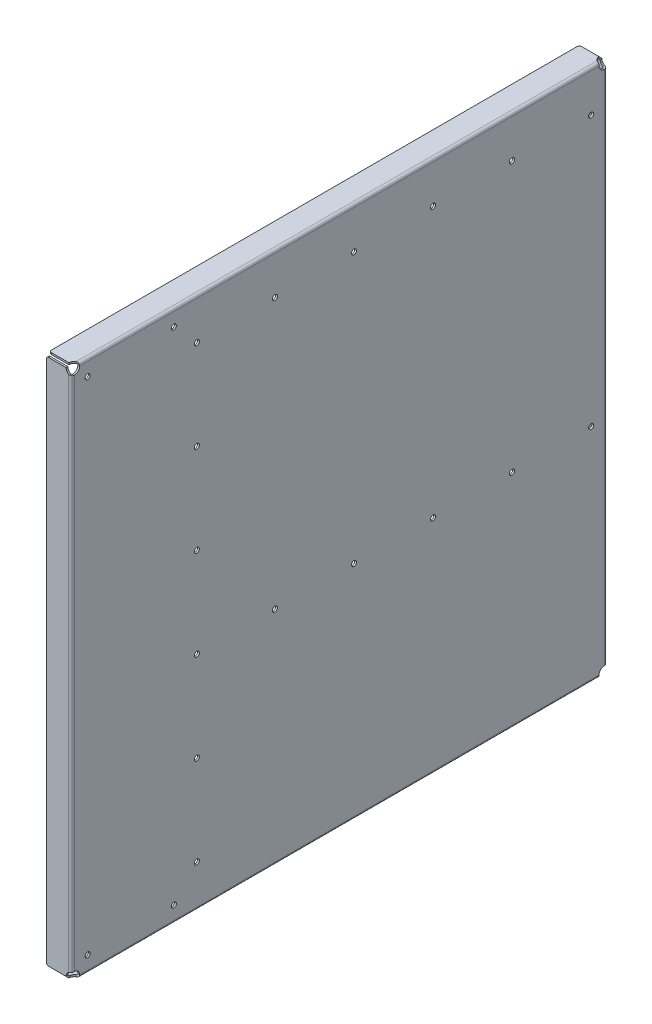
ISO-10303-21;
HEADER;
FILE_DESCRIPTION(('STEP AP214'),'2;1');
FILE_NAME('part.step','',(''),(''),'','','');
FILE_SCHEMA(('AUTOMOTIVE_DESIGN { 1 0 10303 214 1 1 1 1 }'));
ENDSEC;
DATA;
#1=APPLICATION_CONTEXT('core data for automotive mechanical design processes');
#2=APPLICATION_PROTOCOL_DEFINITION('international standard','automotive_design',2000,#1);
#3=PRODUCT_CONTEXT('',#1,'mechanical');
#4=PRODUCT('Part','Part','',(#3));
#5=PRODUCT_RELATED_PRODUCT_CATEGORY('part','',(#4));
#6=PRODUCT_DEFINITION_FORMATION('','',#4);
#7=PRODUCT_DEFINITION_CONTEXT('part definition',#1,'design');
#8=PRODUCT_DEFINITION('design','',#6,#7);
#9=PRODUCT_DEFINITION_SHAPE('','',#8);
#10=(LENGTH_UNIT() NAMED_UNIT(*) SI_UNIT(.MILLI.,.METRE.));
#11=(NAMED_UNIT(*) PLANE_ANGLE_UNIT() SI_UNIT($,.RADIAN.));
#12=(NAMED_UNIT(*) SI_UNIT($,.STERADIAN.) SOLID_ANGLE_UNIT());
#13=UNCERTAINTY_MEASURE_WITH_UNIT(LENGTH_MEASURE(1.E-05),#10,'distance_accuracy_value','');
#14=(GEOMETRIC_REPRESENTATION_CONTEXT(3) GLOBAL_UNCERTAINTY_ASSIGNED_CONTEXT((#13)) GLOBAL_UNIT_ASSIGNED_CONTEXT((#10,
#11,#12)) REPRESENTATION_CONTEXT('',''));
#15=CARTESIAN_POINT('',(0.,0.,0.));
#16=DIRECTION('',(0.,0.,1.));
#17=DIRECTION('',(1.,0.,0.));
#18=AXIS2_PLACEMENT_3D('',#15,#16,#17);
#19=CARTESIAN_POINT('',(1.5875,0.,0.));
#20=DIRECTION('',(1.,0.,0.));
#21=DIRECTION('',(0.,0.,1.));
#22=AXIS2_PLACEMENT_3D('',#19,#20,#21);
#23=PLANE('',#22);
#24=CARTESIAN_POINT('',(1.5875,435.4874999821,-460.237500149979));
#25=DIRECTION('',(-1.,0.,0.));
#26=DIRECTION('',(0.,0.,1.));
#27=AXIS2_PLACEMENT_3D('',#24,#25,#26);
#28=CIRCLE('',#27,2.24999999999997);
#29=CARTESIAN_POINT('',(1.5875,435.4874999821,-457.987500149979));
#30=VERTEX_POINT('',#29);
#31=EDGE_CURVE('E1279',#30,#30,#28,.T.);
#32=ORIENTED_EDGE('',*,*,#31,.T.);
#33=EDGE_LOOP('',(#32));
#34=FACE_BOUND('',#33,.T.);
#35=CARTESIAN_POINT('',(1.5875,435.487499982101,-390.237500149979));
#36=DIRECTION('',(-1.,0.,0.));
#37=DIRECTION('',(0.,0.,1.));
#38=AXIS2_PLACEMENT_3D('',#35,#36,#37);
#39=CIRCLE('',#38,2.24999999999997);
#40=CARTESIAN_POINT('',(1.5875,435.487499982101,-387.987500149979));
#41=VERTEX_POINT('',#40);
#42=EDGE_CURVE('E1283',#41,#41,#39,.T.);
#43=ORIENTED_EDGE('',*,*,#42,.T.);
#44=EDGE_LOOP('',(#43));
#45=FACE_BOUND('',#44,.T.);
#46=CARTESIAN_POINT('',(1.5875,435.487499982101,-320.237500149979));
#47=DIRECTION('',(-1.,0.,0.));
#48=DIRECTION('',(0.,0.,1.));
#49=AXIS2_PLACEMENT_3D('',#46,#47,#48);
#50=CIRCLE('',#49,2.24999999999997);
#51=CARTESIAN_POINT('',(1.5875,435.487499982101,-317.987500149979));
#52=VERTEX_POINT('',#51);
#53=EDGE_CURVE('E1287',#52,#52,#50,.T.);
#54=ORIENTED_EDGE('',*,*,#53,.T.);
#55=EDGE_LOOP('',(#54));
#56=FACE_BOUND('',#55,.T.);
#57=CARTESIAN_POINT('',(1.5875,435.487499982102,-250.237500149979));
#58=DIRECTION('',(-1.,0.,0.));
#59=DIRECTION('',(0.,0.,1.));
#60=AXIS2_PLACEMENT_3D('',#57,#58,#59);
#61=CIRCLE('',#60,2.24999999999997);
#62=CARTESIAN_POINT('',(1.5875,435.487499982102,-247.987500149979));
#63=VERTEX_POINT('',#62);
#64=EDGE_CURVE('E1291',#63,#63,#61,.T.);
#65=ORIENTED_EDGE('',*,*,#64,.T.);
#66=EDGE_LOOP('',(#65));
#67=FACE_BOUND('',#66,.T.);
#68=CARTESIAN_POINT('',(1.5875,435.487499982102,-180.237500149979));
#69=DIRECTION('',(-1.,0.,0.));
#70=DIRECTION('',(0.,0.,1.));
#71=AXIS2_PLACEMENT_3D('',#68,#69,#70);
#72=CIRCLE('',#71,2.24999999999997);
#73=CARTESIAN_POINT('',(1.5875,435.487499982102,-177.987500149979));
#74=VERTEX_POINT('',#73);
#75=EDGE_CURVE('E1295',#74,#74,#72,.T.);
#76=ORIENTED_EDGE('',*,*,#75,.T.);
#77=EDGE_LOOP('',(#76));
#78=FACE_BOUND('',#77,.T.);
#79=CARTESIAN_POINT('',(1.5875,457.712500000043,-90.6500004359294));
#80=DIRECTION('',(-1.,0.,0.));
#81=DIRECTION('',(0.,0.,1.));
#82=AXIS2_PLACEMENT_3D('',#79,#80,#81);
#83=CIRCLE('',#82,2.24999999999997);
#84=CARTESIAN_POINT('',(1.5875,457.712500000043,-88.4000004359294));
#85=VERTEX_POINT('',#84);
#86=EDGE_CURVE('E1299',#85,#85,#83,.T.);
#87=ORIENTED_EDGE('',*,*,#86,.T.);
#88=EDGE_LOOP('',(#87));
#89=FACE_BOUND('',#88,.T.);
#90=CARTESIAN_POINT('',(1.5875,457.712500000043,-14.3499999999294));
#91=DIRECTION('',(-1.,0.,0.));
#92=DIRECTION('',(0.,0.,1.));
#93=AXIS2_PLACEMENT_3D('',#90,#91,#92);
#94=CIRCLE('',#93,2.24999999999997);
#95=CARTESIAN_POINT('',(1.5875,457.712500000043,-12.0999999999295));
#96=VERTEX_POINT('',#95);
#97=EDGE_CURVE('E1303',#96,#96,#94,.T.);
#98=ORIENTED_EDGE('',*,*,#97,.T.);
#99=EDGE_LOOP('',(#98));
#100=FACE_BOUND('',#99,.T.);
#101=CARTESIAN_POINT('',(1.5875,435.487499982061,-111.07250010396));
#102=DIRECTION('',(-1.,0.,0.));
#103=DIRECTION('',(0.,0.,1.));
#104=AXIS2_PLACEMENT_3D('',#101,#102,#103);
#105=CIRCLE('',#104,2.24999999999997);
#106=CARTESIAN_POINT('',(1.5875,435.487499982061,-108.82250010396));
#107=VERTEX_POINT('',#106);
#108=EDGE_CURVE('E1307',#107,#107,#105,.T.);
#109=ORIENTED_EDGE('',*,*,#108,.T.);
#110=EDGE_LOOP('',(#109));
#111=FACE_BOUND('',#110,.T.);
#112=CARTESIAN_POINT('',(1.5875,355.813166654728,-111.07250010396));
#113=DIRECTION('',(-1.,0.,0.));
#114=DIRECTION('',(0.,0.,1.));
#115=AXIS2_PLACEMENT_3D('',#112,#113,#114);
#116=CIRCLE('',#115,2.24999999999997);
#117=CARTESIAN_POINT('',(1.5875,355.813166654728,-108.82250010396));
#118=VERTEX_POINT('',#117);
#119=EDGE_CURVE('E1311',#118,#118,#116,.T.);
#120=ORIENTED_EDGE('',*,*,#119,.T.);
#121=EDGE_LOOP('',(#120));
#122=FACE_BOUND('',#121,.T.);
#123=CARTESIAN_POINT('',(1.5875,276.138833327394,-111.07250010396));
#124=DIRECTION('',(-1.,0.,0.));
#125=DIRECTION('',(0.,0.,1.));
#126=AXIS2_PLACEMENT_3D('',#123,#124,#125);
#127=CIRCLE('',#126,2.24999999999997);
#128=CARTESIAN_POINT('',(1.5875,276.138833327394,-108.82250010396));
#129=VERTEX_POINT('',#128);
#130=EDGE_CURVE('E1315',#129,#129,#127,.T.);
#131=ORIENTED_EDGE('',*,*,#130,.T.);
#132=EDGE_LOOP('',(#131));
#133=FACE_BOUND('',#132,.T.);
#134=CARTESIAN_POINT('',(1.5875,196.46450000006,-111.07250010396));
#135=DIRECTION('',(-1.,0.,0.));
#136=DIRECTION('',(0.,0.,1.));
#137=AXIS2_PLACEMENT_3D('',#134,#135,#136);
#138=CIRCLE('',#137,2.25);
#139=CARTESIAN_POINT('',(1.5875,196.46450000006,-108.82250010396));
#140=VERTEX_POINT('',#139);
#141=EDGE_CURVE('E1319',#140,#140,#138,.T.);
#142=ORIENTED_EDGE('',*,*,#141,.T.);
#143=EDGE_LOOP('',(#142));
#144=FACE_BOUND('',#143,.T.);
#145=CARTESIAN_POINT('',(1.5875,116.790166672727,-111.07250010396));
#146=DIRECTION('',(-1.,0.,0.));
#147=DIRECTION('',(0.,0.,1.));
#148=AXIS2_PLACEMENT_3D('',#145,#146,#147);
#149=CIRCLE('',#148,2.25);
#150=CARTESIAN_POINT('',(1.5875,116.790166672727,-108.82250010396));
#151=VERTEX_POINT('',#150);
#152=EDGE_CURVE('E1323',#151,#151,#149,.T.);
#153=ORIENTED_EDGE('',*,*,#152,.T.);
#154=EDGE_LOOP('',(#153));
#155=FACE_BOUND('',#154,.T.);
#156=CARTESIAN_POINT('',(1.5875,37.1158333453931,-111.07250010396));
#157=DIRECTION('',(-1.,0.,0.));
#158=DIRECTION('',(0.,0.,1.));
#159=AXIS2_PLACEMENT_3D('',#156,#157,#158);
#160=CIRCLE('',#159,2.25);
#161=CARTESIAN_POINT('',(1.5875,37.1158333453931,-108.82250010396));
#162=VERTEX_POINT('',#161);
#163=EDGE_CURVE('E1327',#162,#162,#160,.T.);
#164=ORIENTED_EDGE('',*,*,#163,.T.);
#165=EDGE_LOOP('',(#164));
#166=FACE_BOUND('',#165,.T.);
#167=CARTESIAN_POINT('',(1.5875,196.46450000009,-180.237500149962));
#168=DIRECTION('',(-1.,0.,0.));
#169=DIRECTION('',(0.,0.,1.));
#170=AXIS2_PLACEMENT_3D('',#167,#168,#169);
#171=CIRCLE('',#170,2.25);
#172=CARTESIAN_POINT('',(1.5875,196.46450000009,-177.987500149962));
#173=VERTEX_POINT('',#172);
#174=EDGE_CURVE('E1331',#173,#173,#171,.T.);
#175=ORIENTED_EDGE('',*,*,#174,.T.);
#176=EDGE_LOOP('',(#175));
#177=FACE_BOUND('',#176,.T.);
#178=CARTESIAN_POINT('',(1.5875,196.46450000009,-250.237500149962));
#179=DIRECTION('',(-1.,0.,0.));
#180=DIRECTION('',(0.,0.,1.));
#181=AXIS2_PLACEMENT_3D('',#178,#179,#180);
#182=CIRCLE('',#181,2.25);
#183=CARTESIAN_POINT('',(1.5875,196.46450000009,-247.987500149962));
#184=VERTEX_POINT('',#183);
#185=EDGE_CURVE('E1335',#184,#184,#182,.T.);
#186=ORIENTED_EDGE('',*,*,#185,.T.);
#187=EDGE_LOOP('',(#186));
#188=FACE_BOUND('',#187,.T.);
#189=CARTESIAN_POINT('',(1.5875,196.46450000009,-320.237500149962));
#190=DIRECTION('',(-1.,0.,0.));
#191=DIRECTION('',(0.,0.,1.));
#192=AXIS2_PLACEMENT_3D('',#189,#190,#191);
#193=CIRCLE('',#192,2.25);
#194=CARTESIAN_POINT('',(1.5875,196.46450000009,-317.987500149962));
#195=VERTEX_POINT('',#194);
#196=EDGE_CURVE('E1339',#195,#195,#193,.T.);
#197=ORIENTED_EDGE('',*,*,#196,.T.);
#198=EDGE_LOOP('',(#197));
#199=FACE_BOUND('',#198,.T.);
#200=CARTESIAN_POINT('',(1.5875,196.46450000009,-390.237500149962));
#201=DIRECTION('',(-1.,0.,0.));
#202=DIRECTION('',(0.,0.,1.));
#203=AXIS2_PLACEMENT_3D('',#200,#201,#202);
#204=CIRCLE('',#203,2.25);
#205=CARTESIAN_POINT('',(1.5875,196.46450000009,-387.987500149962));
#206=VERTEX_POINT('',#205);
#207=EDGE_CURVE('E1343',#206,#206,#204,.T.);
#208=ORIENTED_EDGE('',*,*,#207,.T.);
#209=EDGE_LOOP('',(#208));
#210=FACE_BOUND('',#209,.T.);
#211=CARTESIAN_POINT('',(1.5875,196.46450000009,-460.237500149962));
#212=DIRECTION('',(-1.,0.,0.));
#213=DIRECTION('',(0.,0.,1.));
#214=AXIS2_PLACEMENT_3D('',#211,#212,#213);
#215=CIRCLE('',#214,2.25);
#216=CARTESIAN_POINT('',(1.5875,196.46450000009,-457.987500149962));
#217=VERTEX_POINT('',#216);
#218=EDGE_CURVE('E1347',#217,#217,#215,.T.);
#219=ORIENTED_EDGE('',*,*,#218,.T.);
#220=EDGE_LOOP('',(#219));
#221=FACE_BOUND('',#220,.T.);
#222=CARTESIAN_POINT('',(1.5875,14.2924998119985,-90.6500004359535));
#223=DIRECTION('',(-1.,0.,0.));
#224=DIRECTION('',(0.,0.,1.));
#225=AXIS2_PLACEMENT_3D('',#222,#223,#224);
#226=CIRCLE('',#225,2.25);
#227=CARTESIAN_POINT('',(1.5875,14.2924998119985,-88.4000004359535));
#228=VERTEX_POINT('',#227);
#229=EDGE_CURVE('E1351',#228,#228,#226,.T.);
#230=ORIENTED_EDGE('',*,*,#229,.T.);
#231=EDGE_LOOP('',(#230));
#232=FACE_BOUND('',#231,.T.);
#233=CARTESIAN_POINT('',(1.5875,14.2924998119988,-14.3499999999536));
#234=DIRECTION('',(-1.,0.,0.));
#235=DIRECTION('',(0.,0.,1.));
#236=AXIS2_PLACEMENT_3D('',#233,#234,#235);
#237=CIRCLE('',#236,2.25);
#238=CARTESIAN_POINT('',(1.5875,14.2924998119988,-12.0999999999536));
#239=VERTEX_POINT('',#238);
#240=EDGE_CURVE('E1355',#239,#239,#237,.T.);
#241=ORIENTED_EDGE('',*,*,#240,.T.);
#242=EDGE_LOOP('',(#241));
#243=FACE_BOUND('',#242,.T.);
#244=DIRECTION('',(0.,-1.,0.));
#245=VECTOR('',#244,1.);
#246=CARTESIAN_POINT('',(1.5875,2.47649999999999,-2.4765));
#247=LINE('',#246,#245);
#248=CARTESIAN_POINT('',(1.5875,7.24801705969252,-2.47649999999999));
#249=VERTEX_POINT('',#248);
#250=CARTESIAN_POINT('',(1.5875,464.751982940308,-2.4765));
#251=VERTEX_POINT('',#250);
#252=EDGE_CURVE('E1065',#249,#251,#247,.F.);
#253=ORIENTED_EDGE('',*,*,#252,.F.);
#254=CARTESIAN_POINT('',(1.5875,2.48552561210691,-2.48552561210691));
#255=DIRECTION('',(-1.,0.,0.));
#256=DIRECTION('',(0.,0.,1.));
#257=AXIS2_PLACEMENT_3D('',#254,#255,#256);
#258=CIRCLE('',#257,4.7625);
#259=CARTESIAN_POINT('',(1.5875,2.4765,-7.2480170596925));
#260=VERTEX_POINT('',#259);
#261=EDGE_CURVE('E668',#249,#260,#258,.T.);
#262=ORIENTED_EDGE('',*,*,#261,.T.);
#263=DIRECTION('',(0.,0.,-1.));
#264=VECTOR('',#263,1.);
#265=CARTESIAN_POINT('',(1.5875,2.4765,-472.11100015));
#266=LINE('',#265,#264);
#267=CARTESIAN_POINT('',(1.5875,2.47650000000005,-467.339483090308));
#268=VERTEX_POINT('',#267);
#269=EDGE_CURVE('E1029',#268,#260,#266,.F.);
#270=ORIENTED_EDGE('',*,*,#269,.F.);
#271=CARTESIAN_POINT('',(1.5875,2.48552561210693,-472.101974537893));
#272=DIRECTION('',(-1.,0.,0.));
#273=DIRECTION('',(0.,0.,1.));
#274=AXIS2_PLACEMENT_3D('',#271,#272,#273);
#275=CIRCLE('',#274,4.7625);
#276=CARTESIAN_POINT('',(1.5875,7.24801705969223,-472.11100015));
#277=VERTEX_POINT('',#276);
#278=EDGE_CURVE('E840',#268,#277,#275,.T.);
#279=ORIENTED_EDGE('',*,*,#278,.T.);
#280=DIRECTION('',(0.,1.,0.));
#281=VECTOR('',#280,1.);
#282=CARTESIAN_POINT('',(1.5875,469.5235,-472.11100015));
#283=LINE('',#282,#281);
#284=CARTESIAN_POINT('',(1.5875,464.751982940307,-472.11100015));
#285=VERTEX_POINT('',#284);
#286=EDGE_CURVE('E1045',#285,#277,#283,.F.);
#287=ORIENTED_EDGE('',*,*,#286,.F.);
#288=CARTESIAN_POINT('',(1.5875,469.514474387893,-472.101974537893));
#289=DIRECTION('',(-1.,0.,0.));
#290=DIRECTION('',(0.,0.,1.));
#291=AXIS2_PLACEMENT_3D('',#288,#289,#290);
#292=CIRCLE('',#291,4.7625);
#293=CARTESIAN_POINT('',(1.5875,469.5235,-467.339483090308));
#294=VERTEX_POINT('',#293);
#295=EDGE_CURVE('E497',#285,#294,#292,.T.);
#296=ORIENTED_EDGE('',*,*,#295,.T.);
#297=DIRECTION('',(0.,0.,1.));
#298=VECTOR('',#297,1.);
#299=CARTESIAN_POINT('',(1.5875,469.5235,-2.47650000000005));
#300=LINE('',#299,#298);
#301=CARTESIAN_POINT('',(1.5875,469.5235,-7.2480170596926));
#302=VERTEX_POINT('',#301);
#303=EDGE_CURVE('E1211',#302,#294,#300,.F.);
#304=ORIENTED_EDGE('',*,*,#303,.F.);
#305=CARTESIAN_POINT('',(1.5875,469.514474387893,-2.48552561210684));
#306=DIRECTION('',(-1.,0.,0.));
#307=DIRECTION('',(0.,0.,1.));
#308=AXIS2_PLACEMENT_3D('',#305,#306,#307);
#309=CIRCLE('',#308,4.7625);
#310=EDGE_CURVE('E393',#302,#251,#309,.T.);
#311=ORIENTED_EDGE('',*,*,#310,.T.);
#312=EDGE_LOOP('',(#253,#262,#270,#279,#287,#296,#304,#311));
#313=FACE_BOUND('',#312,.T.);
#314=ADVANCED_FACE('F45',(#34,#45,#56,#67,#78,#89,#100,#111,#122,#133,#144,#155,#166,#177,#188,
#199,#210,#221,#232,#243,#313),#23,.T.);
#315=CARTESIAN_POINT('',(0.,0.,0.));
#316=DIRECTION('',(1.,0.,0.));
#317=DIRECTION('',(0.,0.,1.));
#318=AXIS2_PLACEMENT_3D('',#315,#316,#317);
#319=PLANE('',#318);
#320=CARTESIAN_POINT('',(0.,435.4874999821,-460.237500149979));
#321=DIRECTION('',(-1.,0.,0.));
#322=DIRECTION('',(0.,0.,1.));
#323=AXIS2_PLACEMENT_3D('',#320,#321,#322);
#324=CIRCLE('',#323,2.24999999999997);
#325=CARTESIAN_POINT('',(0.,435.4874999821,-457.987500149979));
#326=VERTEX_POINT('',#325);
#327=EDGE_CURVE('E2344',#326,#326,#324,.T.);
#328=ORIENTED_EDGE('',*,*,#327,.F.);
#329=EDGE_LOOP('',(#328));
#330=FACE_BOUND('',#329,.T.);
#331=CARTESIAN_POINT('',(0.,435.487499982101,-390.237500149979));
#332=DIRECTION('',(-1.,0.,0.));
#333=DIRECTION('',(0.,0.,1.));
#334=AXIS2_PLACEMENT_3D('',#331,#332,#333);
#335=CIRCLE('',#334,2.24999999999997);
#336=CARTESIAN_POINT('',(0.,435.487499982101,-387.987500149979));
#337=VERTEX_POINT('',#336);
#338=EDGE_CURVE('E2349',#337,#337,#335,.T.);
#339=ORIENTED_EDGE('',*,*,#338,.F.);
#340=EDGE_LOOP('',(#339));
#341=FACE_BOUND('',#340,.T.);
#342=CARTESIAN_POINT('',(0.,435.487499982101,-320.237500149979));
#343=DIRECTION('',(-1.,0.,0.));
#344=DIRECTION('',(0.,0.,1.));
#345=AXIS2_PLACEMENT_3D('',#342,#343,#344);
#346=CIRCLE('',#345,2.24999999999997);
#347=CARTESIAN_POINT('',(0.,435.487499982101,-317.987500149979));
#348=VERTEX_POINT('',#347);
#349=EDGE_CURVE('E2353',#348,#348,#346,.T.);
#350=ORIENTED_EDGE('',*,*,#349,.F.);
#351=EDGE_LOOP('',(#350));
#352=FACE_BOUND('',#351,.T.);
#353=CARTESIAN_POINT('',(0.,435.487499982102,-250.237500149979));
#354=DIRECTION('',(-1.,0.,0.));
#355=DIRECTION('',(0.,0.,1.));
#356=AXIS2_PLACEMENT_3D('',#353,#354,#355);
#357=CIRCLE('',#356,2.24999999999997);
#358=CARTESIAN_POINT('',(0.,435.487499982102,-247.987500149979));
#359=VERTEX_POINT('',#358);
#360=EDGE_CURVE('E2357',#359,#359,#357,.T.);
#361=ORIENTED_EDGE('',*,*,#360,.F.);
#362=EDGE_LOOP('',(#361));
#363=FACE_BOUND('',#362,.T.);
#364=CARTESIAN_POINT('',(0.,435.487499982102,-180.237500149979));
#365=DIRECTION('',(-1.,0.,0.));
#366=DIRECTION('',(0.,0.,1.));
#367=AXIS2_PLACEMENT_3D('',#364,#365,#366);
#368=CIRCLE('',#367,2.24999999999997);
#369=CARTESIAN_POINT('',(0.,435.487499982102,-177.987500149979));
#370=VERTEX_POINT('',#369);
#371=EDGE_CURVE('E2361',#370,#370,#368,.T.);
#372=ORIENTED_EDGE('',*,*,#371,.F.);
#373=EDGE_LOOP('',(#372));
#374=FACE_BOUND('',#373,.T.);
#375=CARTESIAN_POINT('',(0.,457.712500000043,-90.6500004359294));
#376=DIRECTION('',(-1.,0.,0.));
#377=DIRECTION('',(0.,0.,1.));
#378=AXIS2_PLACEMENT_3D('',#375,#376,#377);
#379=CIRCLE('',#378,2.24999999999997);
#380=CARTESIAN_POINT('',(0.,457.712500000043,-88.4000004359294));
#381=VERTEX_POINT('',#380);
#382=EDGE_CURVE('E2365',#381,#381,#379,.T.);
#383=ORIENTED_EDGE('',*,*,#382,.F.);
#384=EDGE_LOOP('',(#383));
#385=FACE_BOUND('',#384,.T.);
#386=CARTESIAN_POINT('',(0.,457.712500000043,-14.3499999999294));
#387=DIRECTION('',(-1.,0.,0.));
#388=DIRECTION('',(0.,0.,1.));
#389=AXIS2_PLACEMENT_3D('',#386,#387,#388);
#390=CIRCLE('',#389,2.24999999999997);
#391=CARTESIAN_POINT('',(0.,457.712500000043,-12.0999999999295));
#392=VERTEX_POINT('',#391);
#393=EDGE_CURVE('E2369',#392,#392,#390,.T.);
#394=ORIENTED_EDGE('',*,*,#393,.F.);
#395=EDGE_LOOP('',(#394));
#396=FACE_BOUND('',#395,.T.);
#397=CARTESIAN_POINT('',(0.,435.487499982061,-111.07250010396));
#398=DIRECTION('',(-1.,0.,0.));
#399=DIRECTION('',(0.,0.,1.));
#400=AXIS2_PLACEMENT_3D('',#397,#398,#399);
#401=CIRCLE('',#400,2.24999999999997);
#402=CARTESIAN_POINT('',(0.,435.487499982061,-108.82250010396));
#403=VERTEX_POINT('',#402);
#404=EDGE_CURVE('E2373',#403,#403,#401,.T.);
#405=ORIENTED_EDGE('',*,*,#404,.F.);
#406=EDGE_LOOP('',(#405));
#407=FACE_BOUND('',#406,.T.);
#408=CARTESIAN_POINT('',(0.,355.813166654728,-111.07250010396));
#409=DIRECTION('',(-1.,0.,0.));
#410=DIRECTION('',(0.,0.,1.));
#411=AXIS2_PLACEMENT_3D('',#408,#409,#410);
#412=CIRCLE('',#411,2.24999999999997);
#413=CARTESIAN_POINT('',(0.,355.813166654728,-108.82250010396));
#414=VERTEX_POINT('',#413);
#415=EDGE_CURVE('E2377',#414,#414,#412,.T.);
#416=ORIENTED_EDGE('',*,*,#415,.F.);
#417=EDGE_LOOP('',(#416));
#418=FACE_BOUND('',#417,.T.);
#419=CARTESIAN_POINT('',(0.,276.138833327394,-111.07250010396));
#420=DIRECTION('',(-1.,0.,0.));
#421=DIRECTION('',(0.,0.,1.));
#422=AXIS2_PLACEMENT_3D('',#419,#420,#421);
#423=CIRCLE('',#422,2.24999999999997);
#424=CARTESIAN_POINT('',(0.,276.138833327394,-108.82250010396));
#425=VERTEX_POINT('',#424);
#426=EDGE_CURVE('E2381',#425,#425,#423,.T.);
#427=ORIENTED_EDGE('',*,*,#426,.F.);
#428=EDGE_LOOP('',(#427));
#429=FACE_BOUND('',#428,.T.);
#430=CARTESIAN_POINT('',(0.,196.46450000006,-111.07250010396));
#431=DIRECTION('',(-1.,0.,0.));
#432=DIRECTION('',(0.,0.,1.));
#433=AXIS2_PLACEMENT_3D('',#430,#431,#432);
#434=CIRCLE('',#433,2.25);
#435=CARTESIAN_POINT('',(0.,196.46450000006,-108.82250010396));
#436=VERTEX_POINT('',#435);
#437=EDGE_CURVE('E2385',#436,#436,#434,.T.);
#438=ORIENTED_EDGE('',*,*,#437,.F.);
#439=EDGE_LOOP('',(#438));
#440=FACE_BOUND('',#439,.T.);
#441=CARTESIAN_POINT('',(0.,116.790166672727,-111.07250010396));
#442=DIRECTION('',(-1.,0.,0.));
#443=DIRECTION('',(0.,0.,1.));
#444=AXIS2_PLACEMENT_3D('',#441,#442,#443);
#445=CIRCLE('',#444,2.25);
#446=CARTESIAN_POINT('',(0.,116.790166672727,-108.82250010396));
#447=VERTEX_POINT('',#446);
#448=EDGE_CURVE('E2389',#447,#447,#445,.T.);
#449=ORIENTED_EDGE('',*,*,#448,.F.);
#450=EDGE_LOOP('',(#449));
#451=FACE_BOUND('',#450,.T.);
#452=CARTESIAN_POINT('',(0.,37.1158333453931,-111.07250010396));
#453=DIRECTION('',(-1.,0.,0.));
#454=DIRECTION('',(0.,0.,1.));
#455=AXIS2_PLACEMENT_3D('',#452,#453,#454);
#456=CIRCLE('',#455,2.25);
#457=CARTESIAN_POINT('',(0.,37.1158333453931,-108.82250010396));
#458=VERTEX_POINT('',#457);
#459=EDGE_CURVE('E2393',#458,#458,#456,.T.);
#460=ORIENTED_EDGE('',*,*,#459,.F.);
#461=EDGE_LOOP('',(#460));
#462=FACE_BOUND('',#461,.T.);
#463=CARTESIAN_POINT('',(0.,196.46450000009,-180.237500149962));
#464=DIRECTION('',(-1.,0.,0.));
#465=DIRECTION('',(0.,0.,1.));
#466=AXIS2_PLACEMENT_3D('',#463,#464,#465);
#467=CIRCLE('',#466,2.25);
#468=CARTESIAN_POINT('',(0.,196.46450000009,-177.987500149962));
#469=VERTEX_POINT('',#468);
#470=EDGE_CURVE('E2397',#469,#469,#467,.T.);
#471=ORIENTED_EDGE('',*,*,#470,.F.);
#472=EDGE_LOOP('',(#471));
#473=FACE_BOUND('',#472,.T.);
#474=CARTESIAN_POINT('',(0.,196.46450000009,-250.237500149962));
#475=DIRECTION('',(-1.,0.,0.));
#476=DIRECTION('',(0.,0.,1.));
#477=AXIS2_PLACEMENT_3D('',#474,#475,#476);
#478=CIRCLE('',#477,2.25);
#479=CARTESIAN_POINT('',(0.,196.46450000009,-247.987500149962));
#480=VERTEX_POINT('',#479);
#481=EDGE_CURVE('E2401',#480,#480,#478,.T.);
#482=ORIENTED_EDGE('',*,*,#481,.F.);
#483=EDGE_LOOP('',(#482));
#484=FACE_BOUND('',#483,.T.);
#485=CARTESIAN_POINT('',(0.,196.46450000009,-320.237500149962));
#486=DIRECTION('',(-1.,0.,0.));
#487=DIRECTION('',(0.,0.,1.));
#488=AXIS2_PLACEMENT_3D('',#485,#486,#487);
#489=CIRCLE('',#488,2.25);
#490=CARTESIAN_POINT('',(0.,196.46450000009,-317.987500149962));
#491=VERTEX_POINT('',#490);
#492=EDGE_CURVE('E2405',#491,#491,#489,.T.);
#493=ORIENTED_EDGE('',*,*,#492,.F.);
#494=EDGE_LOOP('',(#493));
#495=FACE_BOUND('',#494,.T.);
#496=CARTESIAN_POINT('',(0.,196.46450000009,-390.237500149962));
#497=DIRECTION('',(-1.,0.,0.));
#498=DIRECTION('',(0.,0.,1.));
#499=AXIS2_PLACEMENT_3D('',#496,#497,#498);
#500=CIRCLE('',#499,2.25);
#501=CARTESIAN_POINT('',(0.,196.46450000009,-387.987500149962));
#502=VERTEX_POINT('',#501);
#503=EDGE_CURVE('E2409',#502,#502,#500,.T.);
#504=ORIENTED_EDGE('',*,*,#503,.F.);
#505=EDGE_LOOP('',(#504));
#506=FACE_BOUND('',#505,.T.);
#507=CARTESIAN_POINT('',(0.,196.46450000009,-460.237500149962));
#508=DIRECTION('',(-1.,0.,0.));
#509=DIRECTION('',(0.,0.,1.));
#510=AXIS2_PLACEMENT_3D('',#507,#508,#509);
#511=CIRCLE('',#510,2.25);
#512=CARTESIAN_POINT('',(0.,196.46450000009,-457.987500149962));
#513=VERTEX_POINT('',#512);
#514=EDGE_CURVE('E2413',#513,#513,#511,.T.);
#515=ORIENTED_EDGE('',*,*,#514,.F.);
#516=EDGE_LOOP('',(#515));
#517=FACE_BOUND('',#516,.T.);
#518=CARTESIAN_POINT('',(0.,14.2924998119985,-90.6500004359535));
#519=DIRECTION('',(-1.,0.,0.));
#520=DIRECTION('',(0.,0.,1.));
#521=AXIS2_PLACEMENT_3D('',#518,#519,#520);
#522=CIRCLE('',#521,2.25);
#523=CARTESIAN_POINT('',(0.,14.2924998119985,-88.4000004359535));
#524=VERTEX_POINT('',#523);
#525=EDGE_CURVE('E2417',#524,#524,#522,.T.);
#526=ORIENTED_EDGE('',*,*,#525,.F.);
#527=EDGE_LOOP('',(#526));
#528=FACE_BOUND('',#527,.T.);
#529=CARTESIAN_POINT('',(0.,14.2924998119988,-14.3499999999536));
#530=DIRECTION('',(-1.,0.,0.));
#531=DIRECTION('',(0.,0.,1.));
#532=AXIS2_PLACEMENT_3D('',#529,#530,#531);
#533=CIRCLE('',#532,2.25);
#534=CARTESIAN_POINT('',(0.,14.2924998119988,-12.0999999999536));
#535=VERTEX_POINT('',#534);
#536=EDGE_CURVE('E400',#535,#535,#533,.T.);
#537=ORIENTED_EDGE('',*,*,#536,.F.);
#538=EDGE_LOOP('',(#537));
#539=FACE_BOUND('',#538,.T.);
#540=DIRECTION('',(0.,0.,1.));
#541=VECTOR('',#540,1.);
#542=CARTESIAN_POINT('',(0.,469.5235,-2.47650000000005));
#543=LINE('',#542,#541);
#544=CARTESIAN_POINT('',(0.,469.5235,-7.24801705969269));
#545=VERTEX_POINT('',#544);
#546=CARTESIAN_POINT('',(0.,469.5235,-467.339483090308));
#547=VERTEX_POINT('',#546);
#548=EDGE_CURVE('E1049',#545,#547,#543,.F.);
#549=ORIENTED_EDGE('',*,*,#548,.T.);
#550=CARTESIAN_POINT('',(0.,469.514474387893,-472.101974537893));
#551=DIRECTION('',(-1.,0.,0.));
#552=DIRECTION('',(0.,0.,1.));
#553=AXIS2_PLACEMENT_3D('',#550,#551,#552);
#554=CIRCLE('',#553,4.7625);
#555=CARTESIAN_POINT('',(0.,464.751982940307,-472.11100015));
#556=VERTEX_POINT('',#555);
#557=EDGE_CURVE('E491',#556,#547,#554,.T.);
#558=ORIENTED_EDGE('',*,*,#557,.F.);
#559=DIRECTION('',(0.,1.,0.));
#560=VECTOR('',#559,1.);
#561=CARTESIAN_POINT('',(0.,469.5235,-472.11100015));
#562=LINE('',#561,#560);
#563=CARTESIAN_POINT('',(0.,7.24801705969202,-472.11100015));
#564=VERTEX_POINT('',#563);
#565=EDGE_CURVE('E1013',#556,#564,#562,.F.);
#566=ORIENTED_EDGE('',*,*,#565,.T.);
#567=CARTESIAN_POINT('',(0.,2.48552561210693,-472.101974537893));
#568=DIRECTION('',(-1.,0.,0.));
#569=DIRECTION('',(0.,0.,1.));
#570=AXIS2_PLACEMENT_3D('',#567,#568,#569);
#571=CIRCLE('',#570,4.7625);
#572=CARTESIAN_POINT('',(0.,2.47650000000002,-467.339483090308));
#573=VERTEX_POINT('',#572);
#574=EDGE_CURVE('E834',#573,#564,#571,.T.);
#575=ORIENTED_EDGE('',*,*,#574,.F.);
#576=DIRECTION('',(0.,0.,-1.));
#577=VECTOR('',#576,1.);
#578=CARTESIAN_POINT('',(0.,2.4765,-472.11100015));
#579=LINE('',#578,#577);
#580=CARTESIAN_POINT('',(0.,2.4765,-7.24801705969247));
#581=VERTEX_POINT('',#580);
#582=EDGE_CURVE('E998',#573,#581,#579,.F.);
#583=ORIENTED_EDGE('',*,*,#582,.T.);
#584=CARTESIAN_POINT('',(0.,2.48552561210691,-2.48552561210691));
#585=DIRECTION('',(-1.,0.,0.));
#586=DIRECTION('',(0.,0.,1.));
#587=AXIS2_PLACEMENT_3D('',#584,#585,#586);
#588=CIRCLE('',#587,4.7625);
#589=CARTESIAN_POINT('',(0.,7.24801705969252,-2.4765));
#590=VERTEX_POINT('',#589);
#591=EDGE_CURVE('E662',#590,#581,#588,.T.);
#592=ORIENTED_EDGE('',*,*,#591,.F.);
#593=DIRECTION('',(0.,-1.,0.));
#594=VECTOR('',#593,1.);
#595=CARTESIAN_POINT('',(0.,2.47649999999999,-2.4765));
#596=LINE('',#595,#594);
#597=CARTESIAN_POINT('',(0.,464.751982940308,-2.4765));
#598=VERTEX_POINT('',#597);
#599=EDGE_CURVE('E1033',#590,#598,#596,.F.);
#600=ORIENTED_EDGE('',*,*,#599,.T.);
#601=CARTESIAN_POINT('',(0.,469.514474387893,-2.48552561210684));
#602=DIRECTION('',(-1.,0.,0.));
#603=DIRECTION('',(0.,0.,1.));
#604=AXIS2_PLACEMENT_3D('',#601,#602,#603);
#605=CIRCLE('',#604,4.7625);
#606=EDGE_CURVE('E333',#545,#598,#605,.T.);
#607=ORIENTED_EDGE('',*,*,#606,.F.);
#608=EDGE_LOOP('',(#549,#558,#566,#575,#583,#592,#600,#607));
#609=FACE_BOUND('',#608,.T.);
#610=ADVANCED_FACE('F1264',(#330,#341,#352,#363,#374,#385,#396,#407,#418,#429,#440,#451,#462,
#473,#484,#495,#506,#517,#528,#539,#609),#319,.F.);
#611=CARTESIAN_POINT('',(-0.888999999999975,469.5235,-2.47650000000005));
#612=DIRECTION('',(0.,0.,1.));
#613=DIRECTION('',(0.,1.,0.));
#614=AXIS2_PLACEMENT_3D('',#611,#612,#613);
#615=CYLINDRICAL_SURFACE('',#614,2.47649999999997);
#616=ORIENTED_EDGE('',*,*,#303,.T.);
#617=CARTESIAN_POINT('',(-0.888999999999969,472.,-468.019669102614));
#618=CARTESIAN_POINT('',(-0.59555195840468,472.,-467.908907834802));
#619=CARTESIAN_POINT('',(-0.292092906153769,471.947145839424,-467.811284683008));
#620=CARTESIAN_POINT('',(0.290286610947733,471.723418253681,-467.642688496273));
#621=CARTESIAN_POINT('',(0.569328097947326,471.552101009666,-467.57160487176));
#622=CARTESIAN_POINT('',(1.0496255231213,471.099467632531,-467.456156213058));
#623=CARTESIAN_POINT('',(1.24632313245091,470.822198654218,-467.412760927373));
#624=CARTESIAN_POINT('',(1.51538511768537,470.205522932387,-467.35462844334));
#625=CARTESIAN_POINT('',(1.5875,469.866504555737,-467.339891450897));
#626=CARTESIAN_POINT('',(1.5875,469.5235,-467.339483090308));
#627=B_SPLINE_CURVE_WITH_KNOTS('',3,(#617,#618,#619,#620,#621,#622,#623,#624,#625,#626),
.UNSPECIFIED.,.F.,.F.,(4,2,2,2,4),(0.,0.25,0.5,0.75,1.),.UNSPECIFIED.);
#628=CARTESIAN_POINT('',(-0.888999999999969,472.,-468.019669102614));
#629=VERTEX_POINT('',#628);
#630=EDGE_CURVE('E481',#629,#294,#627,.T.);
#631=ORIENTED_EDGE('',*,*,#630,.F.);
#632=DIRECTION('',(0.,0.,1.));
#633=VECTOR('',#632,1.);
#634=CARTESIAN_POINT('',(-0.888999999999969,472.,0.));
#635=LINE('',#634,#633);
#636=CARTESIAN_POINT('',(-0.888999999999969,472.,-6.5678310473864));
#637=VERTEX_POINT('',#636);
#638=EDGE_CURVE('E1053',#629,#637,#635,.T.);
#639=ORIENTED_EDGE('',*,*,#638,.T.);
#640=CARTESIAN_POINT('',(1.5875,469.5235,-7.24801705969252));
#641=CARTESIAN_POINT('',(1.5875,469.866202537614,-7.24760905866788));
#642=CARTESIAN_POINT('',(1.51550785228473,470.205090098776,-7.23287223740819));
#643=CARTESIAN_POINT('',(1.24655688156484,470.821814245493,-7.17473975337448));
#644=CARTESIAN_POINT('',(1.04964096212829,471.099453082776,-7.13129605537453));
#645=CARTESIAN_POINT('',(0.569312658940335,471.552115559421,-7.01594315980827));
#646=CARTESIAN_POINT('',(0.290626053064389,471.723236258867,-6.94495588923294));
#647=CARTESIAN_POINT('',(-0.291718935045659,471.947053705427,-6.7763597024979));
#648=CARTESIAN_POINT('',(-0.595294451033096,472.,-6.67868951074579));
#649=CARTESIAN_POINT('',(-0.888999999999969,472.,-6.56783104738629));
#650=B_SPLINE_CURVE_WITH_KNOTS('',3,(#640,#641,#642,#643,#644,#645,#646,#647,#648,#649),
.UNSPECIFIED.,.F.,.F.,(4,2,2,2,4),(0.,0.25,0.5,0.75,1.),.UNSPECIFIED.);
#651=EDGE_CURVE('E399',#302,#637,#650,.T.);
#652=ORIENTED_EDGE('',*,*,#651,.F.);
#653=EDGE_LOOP('',(#616,#631,#639,#652));
#654=FACE_BOUND('',#653,.T.);
#655=ADVANCED_FACE('F1189',(#654),#615,.T.);
#656=CARTESIAN_POINT('',(-0.888999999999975,469.5235,-2.47650000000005));
#657=DIRECTION('',(0.,0.,1.));
#658=DIRECTION('',(0.,1.,0.));
#659=AXIS2_PLACEMENT_3D('',#656,#657,#658);
#660=CYLINDRICAL_SURFACE('',#659,0.888999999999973);
#661=DIRECTION('',(0.,0.,-1.));
#662=VECTOR('',#661,1.);
#663=CARTESIAN_POINT('',(-0.888999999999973,470.4125,-474.58750015));
#664=LINE('',#663,#662);
#665=CARTESIAN_POINT('',(-0.888999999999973,470.4125,-468.019669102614));
#666=VERTEX_POINT('',#665);
#667=CARTESIAN_POINT('',(-0.888999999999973,470.4125,-6.5678310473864));
#668=VERTEX_POINT('',#667);
#669=EDGE_CURVE('E1056',#666,#668,#664,.F.);
#670=ORIENTED_EDGE('',*,*,#669,.F.);
#671=CARTESIAN_POINT('',(0.,469.5235,-467.339483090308));
#672=CARTESIAN_POINT('',(0.,469.646629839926,-467.339891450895));
#673=CARTESIAN_POINT('',(-0.0258873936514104,469.768328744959,-467.35462844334));
#674=CARTESIAN_POINT('',(-0.12247374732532,469.989699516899,-467.412760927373));
#675=CARTESIAN_POINT('',(-0.193083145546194,470.089231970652,-467.456156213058));
#676=CARTESIAN_POINT('',(-0.365497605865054,470.25171574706,-467.57160487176));
#677=CARTESIAN_POINT('',(-0.46566634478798,470.313214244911,-467.642688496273));
#678=CARTESIAN_POINT('',(-0.674725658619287,470.393526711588,-467.811284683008));
#679=CARTESIAN_POINT('',(-0.783632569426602,470.4125,-467.908879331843));
#680=CARTESIAN_POINT('',(-0.888999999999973,470.4125,-468.019669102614));
#681=B_SPLINE_CURVE_WITH_KNOTS('',3,(#671,#672,#673,#674,#675,#676,#677,#678,#679,#680),
.UNSPECIFIED.,.F.,.F.,(4,2,2,2,4),(0.,0.25,0.5,0.75,1.),.UNSPECIFIED.);
#682=EDGE_CURVE('E487',#666,#547,#681,.F.);
#683=ORIENTED_EDGE('',*,*,#682,.T.);
#684=ORIENTED_EDGE('',*,*,#548,.F.);
#685=CARTESIAN_POINT('',(-0.888999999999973,470.4125,-6.56783104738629));
#686=CARTESIAN_POINT('',(-0.783540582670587,470.4125,-6.67871753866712));
#687=CARTESIAN_POINT('',(-0.674591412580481,470.393493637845,-6.7763597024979));
#688=CARTESIAN_POINT('',(-0.46554449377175,470.313148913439,-6.94495588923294));
#689=CARTESIAN_POINT('',(-0.365503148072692,470.251720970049,-7.01594315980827));
#690=CARTESIAN_POINT('',(-0.193077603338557,470.089226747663,-7.13129605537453));
#691=CARTESIAN_POINT('',(-0.122389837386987,469.989561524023,-7.17473975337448));
#692=CARTESIAN_POINT('',(-0.0258433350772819,469.768173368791,-7.23287223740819));
#693=CARTESIAN_POINT('',(0.,469.646521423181,-7.24760905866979));
#694=CARTESIAN_POINT('',(0.,469.5235,-7.24801705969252));
#695=B_SPLINE_CURVE_WITH_KNOTS('',3,(#685,#686,#687,#688,#689,#690,#691,#692,#693,#694),
.UNSPECIFIED.,.F.,.F.,(4,2,2,2,4),(0.,0.25,0.5,0.75,1.),.UNSPECIFIED.);
#696=EDGE_CURVE('E317',#545,#668,#695,.F.);
#697=ORIENTED_EDGE('',*,*,#696,.T.);
#698=EDGE_LOOP('',(#670,#683,#684,#697));
#699=FACE_BOUND('',#698,.T.);
#700=ADVANCED_FACE('F1178',(#699),#660,.F.);
#701=CARTESIAN_POINT('',(0.,470.4125,-472.101974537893));
#702=DIRECTION('',(0.,0.,-1.));
#703=DIRECTION('',(1.,0.,0.));
#704=AXIS2_PLACEMENT_3D('',#701,#702,#703);
#705=PLANE('',#704);
#706=DIRECTION('',(1.,0.,0.));
#707=VECTOR('',#706,1.);
#708=CARTESIAN_POINT('',(1.24622965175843E-12,472.,-472.101974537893));
#709=LINE('',#708,#707);
#710=CARTESIAN_POINT('',(-18.6375,472.,-472.101974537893));
#711=VERTEX_POINT('',#710);
#712=CARTESIAN_POINT('',(-3.19870800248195,472.,-472.101974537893));
#713=VERTEX_POINT('',#712);
#714=EDGE_CURVE('E1054',#711,#713,#709,.T.);
#715=ORIENTED_EDGE('',*,*,#714,.T.);
#716=DIRECTION('',(0.,-1.,0.));
#717=VECTOR('',#716,1.);
#718=CARTESIAN_POINT('',(-3.19870800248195,472.,-472.101974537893));
#719=LINE('',#718,#717);
#720=CARTESIAN_POINT('',(-3.19870800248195,470.4125,-472.101974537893));
#721=VERTEX_POINT('',#720);
#722=EDGE_CURVE('E494',#713,#721,#719,.T.);
#723=ORIENTED_EDGE('',*,*,#722,.T.);
#724=DIRECTION('',(1.,0.,0.));
#725=VECTOR('',#724,1.);
#726=CARTESIAN_POINT('',(1.24068692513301E-12,470.4125,-472.101974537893));
#727=LINE('',#726,#725);
#728=CARTESIAN_POINT('',(-18.6375,470.4125,-472.101974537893));
#729=VERTEX_POINT('',#728);
#730=EDGE_CURVE('E1057',#721,#729,#727,.F.);
#731=ORIENTED_EDGE('',*,*,#730,.T.);
#732=DIRECTION('',(0.,1.,0.));
#733=VECTOR('',#732,1.);
#734=CARTESIAN_POINT('',(-18.6375,470.4125,-472.101974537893));
#735=LINE('',#734,#733);
#736=EDGE_CURVE('E12',#711,#729,#735,.F.);
#737=ORIENTED_EDGE('',*,*,#736,.F.);
#738=EDGE_LOOP('',(#715,#723,#731,#737));
#739=FACE_BOUND('',#738,.T.);
#740=ADVANCED_FACE('F1188',(#739),#705,.T.);
#741=CARTESIAN_POINT('',(1.27513756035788E-12,472.,0.));
#742=DIRECTION('',(0.,1.,0.));
#743=DIRECTION('',(1.,0.,0.));
#744=AXIS2_PLACEMENT_3D('',#741,#742,#743);
#745=PLANE('',#744);
#746=DIRECTION('',(-1.,0.,0.));
#747=VECTOR('',#746,1.);
#748=CARTESIAN_POINT('',(0.,472.,-2.48552561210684));
#749=LINE('',#748,#747);
#750=CARTESIAN_POINT('',(-18.6375,472.,-2.48552561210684));
#751=VERTEX_POINT('',#750);
#752=CARTESIAN_POINT('',(-3.19870800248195,472.,-2.48552561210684));
#753=VERTEX_POINT('',#752);
#754=EDGE_CURVE('E1059',#751,#753,#749,.F.);
#755=ORIENTED_EDGE('',*,*,#754,.T.);
#756=CARTESIAN_POINT('',(1.56379199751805,472.,-2.48552561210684));
#757=DIRECTION('',(0.,-1.,0.));
#758=DIRECTION('',(1.,0.,0.));
#759=AXIS2_PLACEMENT_3D('',#756,#757,#758);
#760=CIRCLE('',#759,4.7625);
#761=EDGE_CURVE('E396',#753,#637,#760,.T.);
#762=ORIENTED_EDGE('',*,*,#761,.T.);
#763=ORIENTED_EDGE('',*,*,#638,.F.);
#764=CARTESIAN_POINT('',(1.56379199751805,472.,-472.101974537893));
#765=DIRECTION('',(0.,-1.,0.));
#766=DIRECTION('',(1.,0.,0.));
#767=AXIS2_PLACEMENT_3D('',#764,#765,#766);
#768=CIRCLE('',#767,4.7625);
#769=EDGE_CURVE('E479',#629,#713,#768,.T.);
#770=ORIENTED_EDGE('',*,*,#769,.T.);
#771=ORIENTED_EDGE('',*,*,#714,.F.);
#772=CARTESIAN_POINT('',(-18.6375,472.,-470.101974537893));
#773=DIRECTION('',(0.,-1.,0.));
#774=DIRECTION('',(1.,0.,0.));
#775=AXIS2_PLACEMENT_3D('',#772,#773,#774);
#776=CIRCLE('',#775,2.);
#777=CARTESIAN_POINT('',(-20.6375,472.,-470.101974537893));
#778=VERTEX_POINT('',#777);
#779=EDGE_CURVE('E2268',#778,#711,#776,.T.);
#780=ORIENTED_EDGE('',*,*,#779,.F.);
#781=DIRECTION('',(0.,0.,1.));
#782=VECTOR('',#781,1.);
#783=CARTESIAN_POINT('',(-20.6375,472.,0.));
#784=LINE('',#783,#782);
#785=CARTESIAN_POINT('',(-20.6375,472.,-4.48552561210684));
#786=VERTEX_POINT('',#785);
#787=EDGE_CURVE('E1046',#778,#786,#784,.T.);
#788=ORIENTED_EDGE('',*,*,#787,.T.);
#789=CARTESIAN_POINT('',(-18.6375,472.,-4.48552561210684));
#790=DIRECTION('',(0.,-1.,0.));
#791=DIRECTION('',(1.,0.,0.));
#792=AXIS2_PLACEMENT_3D('',#789,#790,#791);
#793=CIRCLE('',#792,2.);
#794=EDGE_CURVE('E2265',#751,#786,#793,.T.);
#795=ORIENTED_EDGE('',*,*,#794,.F.);
#796=EDGE_LOOP('',(#755,#762,#763,#770,#771,#780,#788,#795));
#797=FACE_BOUND('',#796,.T.);
#798=ADVANCED_FACE('F1229',(#797),#745,.T.);
#799=CARTESIAN_POINT('',(1.26959483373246E-12,470.4125,0.));
#800=DIRECTION('',(0.,1.,0.));
#801=DIRECTION('',(1.,0.,0.));
#802=AXIS2_PLACEMENT_3D('',#799,#800,#801);
#803=PLANE('',#802);
#804=DIRECTION('',(0.,0.,-1.));
#805=VECTOR('',#804,1.);
#806=CARTESIAN_POINT('',(-20.6375,470.4125,0.));
#807=LINE('',#806,#805);
#808=CARTESIAN_POINT('',(-20.6375,470.4125,-470.101974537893));
#809=VERTEX_POINT('',#808);
#810=CARTESIAN_POINT('',(-20.6375,470.4125,-4.48552561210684));
#811=VERTEX_POINT('',#810);
#812=EDGE_CURVE('E1050',#809,#811,#807,.F.);
#813=ORIENTED_EDGE('',*,*,#812,.F.);
#814=CARTESIAN_POINT('',(-18.6375,470.4125,-470.101974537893));
#815=DIRECTION('',(0.,-1.,0.));
#816=DIRECTION('',(1.,0.,0.));
#817=AXIS2_PLACEMENT_3D('',#814,#815,#816);
#818=CIRCLE('',#817,2.);
#819=EDGE_CURVE('E2258',#729,#809,#818,.F.);
#820=ORIENTED_EDGE('',*,*,#819,.F.);
#821=ORIENTED_EDGE('',*,*,#730,.F.);
#822=CARTESIAN_POINT('',(1.56379199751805,470.4125,-472.101974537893));
#823=DIRECTION('',(0.,-1.,0.));
#824=DIRECTION('',(1.,0.,0.));
#825=AXIS2_PLACEMENT_3D('',#822,#823,#824);
#826=CIRCLE('',#825,4.7625);
#827=EDGE_CURVE('E485',#666,#721,#826,.T.);
#828=ORIENTED_EDGE('',*,*,#827,.F.);
#829=ORIENTED_EDGE('',*,*,#669,.T.);
#830=CARTESIAN_POINT('',(1.56379199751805,470.4125,-2.48552561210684));
#831=DIRECTION('',(0.,-1.,0.));
#832=DIRECTION('',(1.,0.,0.));
#833=AXIS2_PLACEMENT_3D('',#830,#831,#832);
#834=CIRCLE('',#833,4.7625);
#835=CARTESIAN_POINT('',(-3.19870800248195,470.4125,-2.48552561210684));
#836=VERTEX_POINT('',#835);
#837=EDGE_CURVE('E385',#836,#668,#834,.T.);
#838=ORIENTED_EDGE('',*,*,#837,.F.);
#839=DIRECTION('',(-1.,0.,0.));
#840=VECTOR('',#839,1.);
#841=CARTESIAN_POINT('',(0.,470.4125,-2.48552561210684));
#842=LINE('',#841,#840);
#843=CARTESIAN_POINT('',(-18.6375,470.4125,-2.48552561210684));
#844=VERTEX_POINT('',#843);
#845=EDGE_CURVE('E1062',#836,#844,#842,.T.);
#846=ORIENTED_EDGE('',*,*,#845,.T.);
#847=CARTESIAN_POINT('',(-18.6375,470.4125,-4.48552561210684));
#848=DIRECTION('',(0.,-1.,0.));
#849=DIRECTION('',(1.,0.,0.));
#850=AXIS2_PLACEMENT_3D('',#847,#848,#849);
#851=CIRCLE('',#850,2.);
#852=EDGE_CURVE('E2253',#811,#844,#851,.F.);
#853=ORIENTED_EDGE('',*,*,#852,.F.);
#854=EDGE_LOOP('',(#813,#820,#821,#828,#829,#838,#846,#853));
#855=FACE_BOUND('',#854,.T.);
#856=ADVANCED_FACE('F1771',(#855),#803,.F.);
#857=CARTESIAN_POINT('',(-20.6375,472.,0.));
#858=DIRECTION('',(-1.,0.,0.));
#859=DIRECTION('',(0.,1.,0.));
#860=AXIS2_PLACEMENT_3D('',#857,#858,#859);
#861=PLANE('',#860);
#862=ORIENTED_EDGE('',*,*,#787,.F.);
#863=DIRECTION('',(0.,1.,0.));
#864=VECTOR('',#863,1.);
#865=CARTESIAN_POINT('',(-20.6375,472.,-470.101974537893));
#866=LINE('',#865,#864);
#867=EDGE_CURVE('E2263',#809,#778,#866,.T.);
#868=ORIENTED_EDGE('',*,*,#867,.F.);
#869=ORIENTED_EDGE('',*,*,#812,.T.);
#870=DIRECTION('',(0.,1.,0.));
#871=VECTOR('',#870,1.);
#872=CARTESIAN_POINT('',(-20.6375,470.4125,-4.48552561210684));
#873=LINE('',#872,#871);
#874=EDGE_CURVE('E2261',#786,#811,#873,.F.);
#875=ORIENTED_EDGE('',*,*,#874,.F.);
#876=EDGE_LOOP('',(#862,#868,#869,#875));
#877=FACE_BOUND('',#876,.T.);
#878=ADVANCED_FACE('F1779',(#877),#861,.T.);
#879=CARTESIAN_POINT('',(0.,470.4125,-2.48552561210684));
#880=DIRECTION('',(0.,0.,-1.));
#881=DIRECTION('',(1.,0.,0.));
#882=AXIS2_PLACEMENT_3D('',#879,#880,#881);
#883=PLANE('',#882);
#884=ORIENTED_EDGE('',*,*,#845,.F.);
#885=DIRECTION('',(0.,-1.,0.));
#886=VECTOR('',#885,1.);
#887=CARTESIAN_POINT('',(-3.19870800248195,472.,-2.48552561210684));
#888=LINE('',#887,#886);
#889=EDGE_CURVE('E471',#753,#836,#888,.T.);
#890=ORIENTED_EDGE('',*,*,#889,.F.);
#891=ORIENTED_EDGE('',*,*,#754,.F.);
#892=DIRECTION('',(0.,1.,0.));
#893=VECTOR('',#892,1.);
#894=CARTESIAN_POINT('',(-18.6375,472.,-2.48552561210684));
#895=LINE('',#894,#893);
#896=EDGE_CURVE('E2270',#844,#751,#895,.T.);
#897=ORIENTED_EDGE('',*,*,#896,.F.);
#898=EDGE_LOOP('',(#884,#890,#891,#897));
#899=FACE_BOUND('',#898,.T.);
#900=ADVANCED_FACE('F1150',(#899),#883,.F.);
#901=CARTESIAN_POINT('',(-0.888999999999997,2.47649999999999,-2.4765));
#902=DIRECTION('',(0.,-1.,0.));
#903=DIRECTION('',(0.,0.,1.));
#904=AXIS2_PLACEMENT_3D('',#901,#902,#903);
#905=CYLINDRICAL_SURFACE('',#904,2.4765);
#906=DIRECTION('',(0.,-1.,0.));
#907=VECTOR('',#906,1.);
#908=CARTESIAN_POINT('',(-0.888999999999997,0.,0.));
#909=LINE('',#908,#907);
#910=CARTESIAN_POINT('',(-0.88899999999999,465.432168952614,0.));
#911=VERTEX_POINT('',#910);
#912=CARTESIAN_POINT('',(-0.889000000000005,6.56783104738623,0.));
#913=VERTEX_POINT('',#912);
#914=EDGE_CURVE('E1037',#911,#913,#909,.T.);
#915=ORIENTED_EDGE('',*,*,#914,.T.);
#916=CARTESIAN_POINT('',(1.5875,7.24801705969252,-2.4765));
#917=CARTESIAN_POINT('',(1.5875,7.24760905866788,-2.13379746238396));
#918=CARTESIAN_POINT('',(1.51550785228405,7.23287223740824,-1.7949099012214));
#919=CARTESIAN_POINT('',(1.24655688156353,7.17473975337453,-1.17818575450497));
#920=CARTESIAN_POINT('',(1.04964096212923,7.13129605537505,-0.900546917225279));
#921=CARTESIAN_POINT('',(0.569312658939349,7.01594315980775,-0.447884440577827));
#922=CARTESIAN_POINT('',(0.290626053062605,6.94495588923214,-0.276763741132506));
#923=CARTESIAN_POINT('',(-0.291718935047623,6.77635970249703,-0.0529462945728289));
#924=CARTESIAN_POINT('',(-0.595294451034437,6.67868951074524,0.));
#925=CARTESIAN_POINT('',(-0.888999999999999,6.56783104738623,0.));
#926=B_SPLINE_CURVE_WITH_KNOTS('',3,(#916,#917,#918,#919,#920,#921,#922,#923,#924,#925),
.UNSPECIFIED.,.F.,.F.,(4,2,2,2,4),(0.,0.25,0.5,0.75,1.),.UNSPECIFIED.);
#927=EDGE_CURVE('E646',#249,#913,#926,.T.);
#928=ORIENTED_EDGE('',*,*,#927,.F.);
#929=ORIENTED_EDGE('',*,*,#252,.T.);
#930=CARTESIAN_POINT('',(-0.889000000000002,465.432168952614,0.));
#931=CARTESIAN_POINT('',(-0.595551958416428,465.321407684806,0.));
#932=CARTESIAN_POINT('',(-0.292092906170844,465.223784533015,-0.0528541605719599));
#933=CARTESIAN_POINT('',(0.290286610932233,465.05518834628,-0.276581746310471));
#934=CARTESIAN_POINT('',(0.569328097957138,464.98410472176,-0.447898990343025));
#935=CARTESIAN_POINT('',(1.04962552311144,464.868656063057,-0.900532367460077));
#936=CARTESIAN_POINT('',(1.24632313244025,464.825260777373,-1.17780134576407));
#937=CARTESIAN_POINT('',(1.51538511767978,464.76712829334,-1.79447706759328));
#938=CARTESIAN_POINT('',(1.5875,464.752391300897,-2.13349544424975));
#939=CARTESIAN_POINT('',(1.5875,464.751982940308,-2.47649999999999));
#940=B_SPLINE_CURVE_WITH_KNOTS('',3,(#930,#931,#932,#933,#934,#935,#936,#937,#938,#939),
.UNSPECIFIED.,.F.,.F.,(4,2,2,2,4),(0.,0.25,0.5,0.75,1.),.UNSPECIFIED.);
#941=EDGE_CURVE('E1234',#911,#251,#940,.T.);
#942=ORIENTED_EDGE('',*,*,#941,.F.);
#943=EDGE_LOOP('',(#915,#928,#929,#942));
#944=FACE_BOUND('',#943,.T.);
#945=ADVANCED_FACE('F1140',(#944),#905,.T.);
#946=CARTESIAN_POINT('',(-0.888999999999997,2.47649999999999,-2.4765));
#947=DIRECTION('',(0.,-1.,0.));
#948=DIRECTION('',(0.,0.,1.));
#949=AXIS2_PLACEMENT_3D('',#946,#947,#948);
#950=CYLINDRICAL_SURFACE('',#949,0.889);
#951=ORIENTED_EDGE('',*,*,#599,.F.);
#952=CARTESIAN_POINT('',(-0.888999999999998,6.56783104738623,-1.5875));
#953=CARTESIAN_POINT('',(-0.783540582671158,6.67871753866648,-1.5875));
#954=CARTESIAN_POINT('',(-0.674591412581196,6.77635970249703,-1.60650636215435));
#955=CARTESIAN_POINT('',(-0.465544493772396,6.94495588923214,-1.68685108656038));
#956=CARTESIAN_POINT('',(-0.365503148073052,7.01594315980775,-1.74827902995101));
#957=CARTESIAN_POINT('',(-0.193077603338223,7.13129605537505,-1.91077325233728));
#958=CARTESIAN_POINT('',(-0.122389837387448,7.17473975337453,-2.01043847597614));
#959=CARTESIAN_POINT('',(-0.0258433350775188,7.23287223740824,-2.23182663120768));
#960=CARTESIAN_POINT('',(0.,7.2476090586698,-2.35347857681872));
#961=CARTESIAN_POINT('',(0.,7.24801705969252,-2.4765));
#962=B_SPLINE_CURVE_WITH_KNOTS('',3,(#952,#953,#954,#955,#956,#957,#958,#959,#960,#961),
.UNSPECIFIED.,.F.,.F.,(4,2,2,2,4),(0.,0.25,0.5,0.75,1.),.UNSPECIFIED.);
#963=CARTESIAN_POINT('',(-0.88900000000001,6.56783104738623,-1.5875));
#964=VERTEX_POINT('',#963);
#965=EDGE_CURVE('E659',#590,#964,#962,.F.);
#966=ORIENTED_EDGE('',*,*,#965,.T.);
#967=DIRECTION('',(0.,1.,0.));
#968=VECTOR('',#967,1.);
#969=CARTESIAN_POINT('',(-0.888999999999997,472.,-1.5875));
#970=LINE('',#969,#968);
#971=CARTESIAN_POINT('',(-0.888999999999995,465.432168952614,-1.5875));
#972=VERTEX_POINT('',#971);
#973=EDGE_CURVE('E1038',#972,#964,#970,.F.);
#974=ORIENTED_EDGE('',*,*,#973,.F.);
#975=CARTESIAN_POINT('',(0.,464.751982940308,-2.47649999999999));
#976=CARTESIAN_POINT('',(0.,464.752391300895,-2.35337016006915));
#977=CARTESIAN_POINT('',(-0.02588739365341,464.76712829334,-2.23167125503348));
#978=CARTESIAN_POINT('',(-0.122473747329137,464.825260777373,-2.01030048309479));
#979=CARTESIAN_POINT('',(-0.193083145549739,464.868656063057,-1.91076802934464));
#980=CARTESIAN_POINT('',(-0.365497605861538,464.98410472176,-1.74828425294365));
#981=CARTESIAN_POINT('',(-0.465666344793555,465.05518834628,-1.68678575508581));
#982=CARTESIAN_POINT('',(-0.674725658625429,465.223784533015,-1.60647328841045));
#983=CARTESIAN_POINT('',(-0.783632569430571,465.321379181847,-1.5875));
#984=CARTESIAN_POINT('',(-0.888999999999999,465.432168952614,-1.5875));
#985=B_SPLINE_CURVE_WITH_KNOTS('',3,(#975,#976,#977,#978,#979,#980,#981,#982,#983,#984),
.UNSPECIFIED.,.F.,.F.,(4,2,2,2,4),(0.,0.25,0.5,0.75,1.),.UNSPECIFIED.);
#986=EDGE_CURVE('E316',#972,#598,#985,.F.);
#987=ORIENTED_EDGE('',*,*,#986,.T.);
#988=EDGE_LOOP('',(#951,#966,#974,#987));
#989=FACE_BOUND('',#988,.T.);
#990=ADVANCED_FACE('F1149',(#989),#950,.F.);
#991=CARTESIAN_POINT('',(0.,469.514474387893,-1.5875));
#992=DIRECTION('',(0.,1.,0.));
#993=DIRECTION('',(0.,0.,1.));
#994=AXIS2_PLACEMENT_3D('',#991,#992,#993);
#995=PLANE('',#994);
#996=DIRECTION('',(1.,0.,0.));
#997=VECTOR('',#996,1.);
#998=CARTESIAN_POINT('',(0.,469.514474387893,0.));
#999=LINE('',#998,#997);
#1000=CARTESIAN_POINT('',(-18.6375,469.514474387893,0.));
#1001=VERTEX_POINT('',#1000);
#1002=CARTESIAN_POINT('',(-3.19870800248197,469.514474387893,0.));
#1003=VERTEX_POINT('',#1002);
#1004=EDGE_CURVE('E328',#1001,#1003,#999,.T.);
#1005=ORIENTED_EDGE('',*,*,#1004,.T.);
#1006=DIRECTION('',(0.,0.,-1.));
#1007=VECTOR('',#1006,1.);
#1008=CARTESIAN_POINT('',(-3.19870800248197,469.514474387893,0.));
#1009=LINE('',#1008,#1007);
#1010=CARTESIAN_POINT('',(-3.19870800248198,469.514474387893,-1.58749999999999));
#1011=VERTEX_POINT('',#1010);
#1012=EDGE_CURVE('E309',#1003,#1011,#1009,.T.);
#1013=ORIENTED_EDGE('',*,*,#1012,.T.);
#1014=DIRECTION('',(1.,0.,0.));
#1015=VECTOR('',#1014,1.);
#1016=CARTESIAN_POINT('',(0.,469.514474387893,-1.5875));
#1017=LINE('',#1016,#1015);
#1018=CARTESIAN_POINT('',(-18.6375,469.514474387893,-1.58749999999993));
#1019=VERTEX_POINT('',#1018);
#1020=EDGE_CURVE('E320',#1011,#1019,#1017,.F.);
#1021=ORIENTED_EDGE('',*,*,#1020,.T.);
#1022=DIRECTION('',(0.,0.,1.));
#1023=VECTOR('',#1022,1.);
#1024=CARTESIAN_POINT('',(-18.6375,469.514474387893,-1.58749999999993));
#1025=LINE('',#1024,#1023);
#1026=EDGE_CURVE('E2276',#1001,#1019,#1025,.F.);
#1027=ORIENTED_EDGE('',*,*,#1026,.F.);
#1028=EDGE_LOOP('',(#1005,#1013,#1021,#1027));
#1029=FACE_BOUND('',#1028,.T.);
#1030=ADVANCED_FACE('F331',(#1029),#995,.T.);
#1031=CARTESIAN_POINT('',(0.,0.,0.));
#1032=DIRECTION('',(0.,0.,1.));
#1033=DIRECTION('',(-1.,0.,0.));
#1034=AXIS2_PLACEMENT_3D('',#1031,#1032,#1033);
#1035=PLANE('',#1034);
#1036=DIRECTION('',(0.,-1.,0.));
#1037=VECTOR('',#1036,1.);
#1038=CARTESIAN_POINT('',(-20.6375,0.,0.));
#1039=LINE('',#1038,#1037);
#1040=CARTESIAN_POINT('',(-20.6375,467.514474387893,0.));
#1041=VERTEX_POINT('',#1040);
#1042=CARTESIAN_POINT('',(-20.6375,4.48552561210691,0.));
#1043=VERTEX_POINT('',#1042);
#1044=EDGE_CURVE('E1030',#1041,#1043,#1039,.T.);
#1045=ORIENTED_EDGE('',*,*,#1044,.T.);
#1046=CARTESIAN_POINT('',(-18.6375,4.48552561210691,0.));
#1047=DIRECTION('',(0.,0.,-1.));
#1048=DIRECTION('',(-1.,0.,0.));
#1049=AXIS2_PLACEMENT_3D('',#1046,#1047,#1048);
#1050=CIRCLE('',#1049,2.);
#1051=CARTESIAN_POINT('',(-18.6375,2.48552561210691,0.));
#1052=VERTEX_POINT('',#1051);
#1053=EDGE_CURVE('E2280',#1052,#1043,#1050,.T.);
#1054=ORIENTED_EDGE('',*,*,#1053,.F.);
#1055=DIRECTION('',(-1.,0.,0.));
#1056=VECTOR('',#1055,1.);
#1057=CARTESIAN_POINT('',(0.,2.48552561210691,0.));
#1058=LINE('',#1057,#1056);
#1059=CARTESIAN_POINT('',(-3.1987080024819,2.48552561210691,0.));
#1060=VERTEX_POINT('',#1059);
#1061=EDGE_CURVE('E329',#1052,#1060,#1058,.F.);
#1062=ORIENTED_EDGE('',*,*,#1061,.T.);
#1063=CARTESIAN_POINT('',(1.56379199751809,2.48552561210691,0.));
#1064=DIRECTION('',(0.,0.,-1.));
#1065=DIRECTION('',(-1.,0.,0.));
#1066=AXIS2_PLACEMENT_3D('',#1063,#1064,#1065);
#1067=CIRCLE('',#1066,4.7625);
#1068=EDGE_CURVE('E641',#1060,#913,#1067,.T.);
#1069=ORIENTED_EDGE('',*,*,#1068,.T.);
#1070=ORIENTED_EDGE('',*,*,#914,.F.);
#1071=CARTESIAN_POINT('',(1.56379199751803,469.514474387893,0.));
#1072=DIRECTION('',(0.,0.,-1.));
#1073=DIRECTION('',(-1.,0.,0.));
#1074=AXIS2_PLACEMENT_3D('',#1071,#1072,#1073);
#1075=CIRCLE('',#1074,4.7625);
#1076=EDGE_CURVE('E1233',#911,#1003,#1075,.T.);
#1077=ORIENTED_EDGE('',*,*,#1076,.T.);
#1078=ORIENTED_EDGE('',*,*,#1004,.F.);
#1079=CARTESIAN_POINT('',(-18.6375,467.514474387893,0.));
#1080=DIRECTION('',(0.,0.,-1.));
#1081=DIRECTION('',(-1.,0.,0.));
#1082=AXIS2_PLACEMENT_3D('',#1079,#1080,#1081);
#1083=CIRCLE('',#1082,2.);
#1084=EDGE_CURVE('E2278',#1041,#1001,#1083,.T.);
#1085=ORIENTED_EDGE('',*,*,#1084,.F.);
#1086=EDGE_LOOP('',(#1045,#1054,#1062,#1069,#1070,#1077,#1078,#1085));
#1087=FACE_BOUND('',#1086,.T.);
#1088=ADVANCED_FACE('F1807',(#1087),#1035,.T.);
#1089=CARTESIAN_POINT('',(0.,0.,-1.5875));
#1090=DIRECTION('',(0.,0.,1.));
#1091=DIRECTION('',(-1.,0.,0.));
#1092=AXIS2_PLACEMENT_3D('',#1089,#1090,#1091);
#1093=PLANE('',#1092);
#1094=ORIENTED_EDGE('',*,*,#1020,.F.);
#1095=CARTESIAN_POINT('',(1.56379199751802,469.514474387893,-1.58750000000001));
#1096=DIRECTION('',(0.,0.,-1.));
#1097=DIRECTION('',(-1.,0.,0.));
#1098=AXIS2_PLACEMENT_3D('',#1095,#1096,#1097);
#1099=CIRCLE('',#1098,4.7625);
#1100=EDGE_CURVE('E304',#972,#1011,#1099,.T.);
#1101=ORIENTED_EDGE('',*,*,#1100,.F.);
#1102=ORIENTED_EDGE('',*,*,#973,.T.);
#1103=CARTESIAN_POINT('',(1.56379199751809,2.48552561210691,-1.58750000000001));
#1104=DIRECTION('',(0.,0.,-1.));
#1105=DIRECTION('',(-1.,0.,0.));
#1106=AXIS2_PLACEMENT_3D('',#1103,#1104,#1105);
#1107=CIRCLE('',#1106,4.7625);
#1108=CARTESIAN_POINT('',(-3.19870800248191,2.48552561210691,-1.58749999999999));
#1109=VERTEX_POINT('',#1108);
#1110=EDGE_CURVE('E671',#1109,#964,#1107,.T.);
#1111=ORIENTED_EDGE('',*,*,#1110,.F.);
#1112=DIRECTION('',(-1.,0.,0.));
#1113=VECTOR('',#1112,1.);
#1114=CARTESIAN_POINT('',(0.,2.48552561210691,-1.5875));
#1115=LINE('',#1114,#1113);
#1116=CARTESIAN_POINT('',(-18.6375,2.48552561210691,-1.58749999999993));
#1117=VERTEX_POINT('',#1116);
#1118=EDGE_CURVE('E1042',#1109,#1117,#1115,.T.);
#1119=ORIENTED_EDGE('',*,*,#1118,.T.);
#1120=CARTESIAN_POINT('',(-18.6375,4.48552561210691,-1.58749999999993));
#1121=DIRECTION('',(0.,0.,-1.));
#1122=DIRECTION('',(-1.,0.,0.));
#1123=AXIS2_PLACEMENT_3D('',#1120,#1121,#1122);
#1124=CIRCLE('',#1123,2.);
#1125=CARTESIAN_POINT('',(-20.6375,4.48552561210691,-1.58749999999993));
#1126=VERTEX_POINT('',#1125);
#1127=EDGE_CURVE('E2273',#1126,#1117,#1124,.F.);
#1128=ORIENTED_EDGE('',*,*,#1127,.F.);
#1129=DIRECTION('',(0.,1.,0.));
#1130=VECTOR('',#1129,1.);
#1131=CARTESIAN_POINT('',(-20.6375,0.,-1.58749999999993));
#1132=LINE('',#1131,#1130);
#1133=CARTESIAN_POINT('',(-20.6375,467.514474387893,-1.58749999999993));
#1134=VERTEX_POINT('',#1133);
#1135=EDGE_CURVE('E1034',#1134,#1126,#1132,.F.);
#1136=ORIENTED_EDGE('',*,*,#1135,.F.);
#1137=CARTESIAN_POINT('',(-18.6375,467.514474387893,-1.58749999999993));
#1138=DIRECTION('',(0.,0.,-1.));
#1139=DIRECTION('',(-1.,0.,0.));
#1140=AXIS2_PLACEMENT_3D('',#1137,#1138,#1139);
#1141=CIRCLE('',#1140,2.);
#1142=EDGE_CURVE('E324',#1019,#1134,#1141,.F.);
#1143=ORIENTED_EDGE('',*,*,#1142,.F.);
#1144=EDGE_LOOP('',(#1094,#1101,#1102,#1111,#1119,#1128,#1136,#1143));
#1145=FACE_BOUND('',#1144,.T.);
#1146=ADVANCED_FACE('F321',(#1145),#1093,.F.);
#1147=CARTESIAN_POINT('',(-20.6375,0.,0.));
#1148=DIRECTION('',(-1.,0.,0.));
#1149=DIRECTION('',(0.,0.,-1.));
#1150=AXIS2_PLACEMENT_3D('',#1147,#1148,#1149);
#1151=PLANE('',#1150);
#1152=ORIENTED_EDGE('',*,*,#1135,.T.);
#1153=DIRECTION('',(0.,0.,1.));
#1154=VECTOR('',#1153,1.);
#1155=CARTESIAN_POINT('',(-20.6375,4.48552561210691,-1.58749999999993));
#1156=LINE('',#1155,#1154);
#1157=EDGE_CURVE('E1215',#1043,#1126,#1156,.F.);
#1158=ORIENTED_EDGE('',*,*,#1157,.F.);
#1159=ORIENTED_EDGE('',*,*,#1044,.F.);
#1160=DIRECTION('',(0.,0.,1.));
#1161=VECTOR('',#1160,1.);
#1162=CARTESIAN_POINT('',(-20.6375,467.514474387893,0.));
#1163=LINE('',#1162,#1161);
#1164=EDGE_CURVE('E2283',#1134,#1041,#1163,.T.);
#1165=ORIENTED_EDGE('',*,*,#1164,.F.);
#1166=EDGE_LOOP('',(#1152,#1158,#1159,#1165));
#1167=FACE_BOUND('',#1166,.T.);
#1168=ADVANCED_FACE('F1151',(#1167),#1151,.T.);
#1169=CARTESIAN_POINT('',(0.,2.48552561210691,-1.5875));
#1170=DIRECTION('',(0.,1.,0.));
#1171=DIRECTION('',(0.,0.,1.));
#1172=AXIS2_PLACEMENT_3D('',#1169,#1170,#1171);
#1173=PLANE('',#1172);
#1174=ORIENTED_EDGE('',*,*,#1118,.F.);
#1175=DIRECTION('',(0.,0.,-1.));
#1176=VECTOR('',#1175,1.);
#1177=CARTESIAN_POINT('',(-3.1987080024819,2.48552561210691,0.));
#1178=LINE('',#1177,#1176);
#1179=EDGE_CURVE('E809',#1060,#1109,#1178,.T.);
#1180=ORIENTED_EDGE('',*,*,#1179,.F.);
#1181=ORIENTED_EDGE('',*,*,#1061,.F.);
#1182=DIRECTION('',(0.,0.,1.));
#1183=VECTOR('',#1182,1.);
#1184=CARTESIAN_POINT('',(-18.6375,2.48552561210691,0.));
#1185=LINE('',#1184,#1183);
#1186=EDGE_CURVE('E2252',#1117,#1052,#1185,.T.);
#1187=ORIENTED_EDGE('',*,*,#1186,.F.);
#1188=EDGE_LOOP('',(#1174,#1180,#1181,#1187));
#1189=FACE_BOUND('',#1188,.T.);
#1190=ADVANCED_FACE('F1089',(#1189),#1173,.F.);
#1191=CARTESIAN_POINT('',(-0.888999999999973,469.5235,-472.11100015));
#1192=DIRECTION('',(0.,1.,0.));
#1193=DIRECTION('',(0.,0.,-1.));
#1194=AXIS2_PLACEMENT_3D('',#1191,#1192,#1193);
#1195=CYLINDRICAL_SURFACE('',#1194,2.47649999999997);
#1196=ORIENTED_EDGE('',*,*,#286,.T.);
#1197=CARTESIAN_POINT('',(-0.888999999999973,6.56783104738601,-474.58750015));
#1198=CARTESIAN_POINT('',(-0.595551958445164,6.67859231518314,-474.58750015));
#1199=CARTESIAN_POINT('',(-0.29209290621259,6.77621546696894,-474.534645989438));
#1200=CARTESIAN_POINT('',(0.290286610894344,6.94481165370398,-474.31091840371));
#1201=CARTESIAN_POINT('',(0.569328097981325,7.01589527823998,-474.139601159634));
#1202=CARTESIAN_POINT('',(1.0496255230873,7.13134393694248,-473.686967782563));
#1203=CARTESIAN_POINT('',(1.24632313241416,7.17473922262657,-473.409698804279));
#1204=CARTESIAN_POINT('',(1.51538511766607,7.2328717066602,-472.793023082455));
#1205=CARTESIAN_POINT('',(1.5875,7.24760869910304,-472.454004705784));
#1206=CARTESIAN_POINT('',(1.5875,7.24801705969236,-472.11100015));
#1207=B_SPLINE_CURVE_WITH_KNOTS('',3,(#1197,#1198,#1199,#1200,#1201,#1202,#1203,#1204,#1205,
#1206),.UNSPECIFIED.,.F.,.F.,(4,2,2,2,4),(0.,0.25,0.5,0.75,1.),.UNSPECIFIED.);
#1208=CARTESIAN_POINT('',(-0.888999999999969,6.56783104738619,-474.58750015));
#1209=VERTEX_POINT('',#1208);
#1210=EDGE_CURVE('E825',#1209,#277,#1207,.T.);
#1211=ORIENTED_EDGE('',*,*,#1210,.F.);
#1212=DIRECTION('',(0.,1.,0.));
#1213=VECTOR('',#1212,1.);
#1214=CARTESIAN_POINT('',(-0.888999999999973,0.,-474.58750015));
#1215=LINE('',#1214,#1213);
#1216=CARTESIAN_POINT('',(-0.888999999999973,465.432168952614,-474.58750015));
#1217=VERTEX_POINT('',#1216);
#1218=EDGE_CURVE('E1017',#1209,#1217,#1215,.T.);
#1219=ORIENTED_EDGE('',*,*,#1218,.T.);
#1220=CARTESIAN_POINT('',(1.5875,464.751982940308,-472.11100015));
#1221=CARTESIAN_POINT('',(1.5875,464.752390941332,-472.453702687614));
#1222=CARTESIAN_POINT('',(1.51550785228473,464.767127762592,-472.792590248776));
#1223=CARTESIAN_POINT('',(1.24655688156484,464.825260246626,-473.409314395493));
#1224=CARTESIAN_POINT('',(1.04964096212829,464.868703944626,-473.686953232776));
#1225=CARTESIAN_POINT('',(0.569312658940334,464.984056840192,-474.139615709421));
#1226=CARTESIAN_POINT('',(0.290626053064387,465.055044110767,-474.310736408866));
#1227=CARTESIAN_POINT('',(-0.291718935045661,465.223640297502,-474.534553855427));
#1228=CARTESIAN_POINT('',(-0.595294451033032,465.321310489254,-474.58750015));
#1229=CARTESIAN_POINT('',(-0.888999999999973,465.432168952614,-474.58750015));
#1230=B_SPLINE_CURVE_WITH_KNOTS('',3,(#1220,#1221,#1222,#1223,#1224,#1225,#1226,#1227,#1228,
#1229),.UNSPECIFIED.,.F.,.F.,(4,2,2,2,4),(0.,0.25,0.5,0.75,1.),.UNSPECIFIED.);
#1231=EDGE_CURVE('E482',#285,#1217,#1230,.T.);
#1232=ORIENTED_EDGE('',*,*,#1231,.F.);
#1233=EDGE_LOOP('',(#1196,#1211,#1219,#1232));
#1234=FACE_BOUND('',#1233,.T.);
#1235=ADVANCED_FACE('F1086',(#1234),#1195,.T.);
#1236=CARTESIAN_POINT('',(-0.888999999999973,469.5235,-472.11100015));
#1237=DIRECTION('',(0.,1.,0.));
#1238=DIRECTION('',(0.,0.,-1.));
#1239=AXIS2_PLACEMENT_3D('',#1236,#1237,#1238);
#1240=CYLINDRICAL_SURFACE('',#1239,0.888999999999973);
#1241=DIRECTION('',(0.,-1.,0.));
#1242=VECTOR('',#1241,1.);
#1243=CARTESIAN_POINT('',(-0.888999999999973,0.,-473.00000015));
#1244=LINE('',#1243,#1242);
#1245=CARTESIAN_POINT('',(-0.888999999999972,6.56783104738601,-473.00000015));
#1246=VERTEX_POINT('',#1245);
#1247=CARTESIAN_POINT('',(-0.888999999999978,465.432168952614,-473.00000015));
#1248=VERTEX_POINT('',#1247);
#1249=EDGE_CURVE('E1020',#1246,#1248,#1244,.F.);
#1250=ORIENTED_EDGE('',*,*,#1249,.F.);
#1251=CARTESIAN_POINT('',(0.,7.24801705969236,-472.11100015));
#1252=CARTESIAN_POINT('',(0.,7.24760869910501,-472.234129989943));
#1253=CARTESIAN_POINT('',(-0.0258873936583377,7.2328717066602,-472.355828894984));
#1254=CARTESIAN_POINT('',(-0.122473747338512,7.17473922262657,-472.577199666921));
#1255=CARTESIAN_POINT('',(-0.193083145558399,7.13134393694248,-472.676732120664));
#1256=CARTESIAN_POINT('',(-0.365497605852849,7.01589527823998,-472.839215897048));
#1257=CARTESIAN_POINT('',(-0.465666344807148,6.94481165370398,-472.900714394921));
#1258=CARTESIAN_POINT('',(-0.674725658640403,6.77621546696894,-472.981026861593));
#1259=CARTESIAN_POINT('',(-0.783632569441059,6.67862081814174,-473.00000015));
#1260=CARTESIAN_POINT('',(-0.888999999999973,6.56783104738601,-473.00000015));
#1261=B_SPLINE_CURVE_WITH_KNOTS('',3,(#1251,#1252,#1253,#1254,#1255,#1256,#1257,#1258,#1259,
#1260),.UNSPECIFIED.,.F.,.F.,(4,2,2,2,4),(0.,0.25,0.5,0.75,1.),.UNSPECIFIED.);
#1262=EDGE_CURVE('E830',#1246,#564,#1261,.F.);
#1263=ORIENTED_EDGE('',*,*,#1262,.T.);
#1264=ORIENTED_EDGE('',*,*,#565,.F.);
#1265=CARTESIAN_POINT('',(-0.888999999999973,465.432168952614,-473.00000015));
#1266=CARTESIAN_POINT('',(-0.78354058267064,465.321282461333,-473.00000015));
#1267=CARTESIAN_POINT('',(-0.674591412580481,465.223640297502,-472.980993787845));
#1268=CARTESIAN_POINT('',(-0.46554449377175,465.055044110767,-472.900649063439));
#1269=CARTESIAN_POINT('',(-0.365503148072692,464.984056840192,-472.839221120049));
#1270=CARTESIAN_POINT('',(-0.193077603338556,464.868703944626,-472.676726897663));
#1271=CARTESIAN_POINT('',(-0.122389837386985,464.825260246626,-472.577061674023));
#1272=CARTESIAN_POINT('',(-0.0258433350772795,464.767127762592,-472.355673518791));
#1273=CARTESIAN_POINT('',(0.,464.75239094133,-472.234021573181));
#1274=CARTESIAN_POINT('',(0.,464.751982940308,-472.11100015));
#1275=B_SPLINE_CURVE_WITH_KNOTS('',3,(#1265,#1266,#1267,#1268,#1269,#1270,#1271,#1272,#1273,
#1274),.UNSPECIFIED.,.F.,.F.,(4,2,2,2,4),(0.,0.25,0.5,0.75,1.),.UNSPECIFIED.);
#1276=EDGE_CURVE('E488',#556,#1248,#1275,.F.);
#1277=ORIENTED_EDGE('',*,*,#1276,.T.);
#1278=EDGE_LOOP('',(#1250,#1263,#1264,#1277));
#1279=FACE_BOUND('',#1278,.T.);
#1280=ADVANCED_FACE('F1075',(#1279),#1240,.F.);
#1281=CARTESIAN_POINT('',(0.,2.48552561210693,-473.00000015));
#1282=DIRECTION('',(0.,-1.,0.));
#1283=DIRECTION('',(0.,0.,-1.));
#1284=AXIS2_PLACEMENT_3D('',#1281,#1282,#1283);
#1285=PLANE('',#1284);
#1286=DIRECTION('',(1.,0.,0.));
#1287=VECTOR('',#1286,1.);
#1288=CARTESIAN_POINT('',(1.28209746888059E-12,2.48552561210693,-474.58750015));
#1289=LINE('',#1288,#1287);
#1290=CARTESIAN_POINT('',(-18.6375,2.48552561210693,-474.58750015));
#1291=VERTEX_POINT('',#1290);
#1292=CARTESIAN_POINT('',(-3.19870800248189,2.48552561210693,-474.58750015));
#1293=VERTEX_POINT('',#1292);
#1294=EDGE_CURVE('E1018',#1291,#1293,#1289,.T.);
#1295=ORIENTED_EDGE('',*,*,#1294,.T.);
#1296=DIRECTION('',(0.,0.,1.));
#1297=VECTOR('',#1296,1.);
#1298=CARTESIAN_POINT('',(-3.19870800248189,2.48552561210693,-474.58750015));
#1299=LINE('',#1298,#1297);
#1300=CARTESIAN_POINT('',(-3.19870800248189,2.48552561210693,-473.00000015));
#1301=VERTEX_POINT('',#1300);
#1302=EDGE_CURVE('E837',#1293,#1301,#1299,.T.);
#1303=ORIENTED_EDGE('',*,*,#1302,.T.);
#1304=DIRECTION('',(1.,0.,0.));
#1305=VECTOR('',#1304,1.);
#1306=CARTESIAN_POINT('',(1.27655474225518E-12,2.48552561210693,-473.00000015));
#1307=LINE('',#1306,#1305);
#1308=CARTESIAN_POINT('',(-18.6375,2.48552561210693,-473.00000015));
#1309=VERTEX_POINT('',#1308);
#1310=EDGE_CURVE('E1021',#1301,#1309,#1307,.F.);
#1311=ORIENTED_EDGE('',*,*,#1310,.T.);
#1312=DIRECTION('',(0.,0.,-1.));
#1313=VECTOR('',#1312,1.);
#1314=CARTESIAN_POINT('',(-18.6375,2.48552561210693,-473.00000015));
#1315=LINE('',#1314,#1313);
#1316=EDGE_CURVE('E2208',#1291,#1309,#1315,.F.);
#1317=ORIENTED_EDGE('',*,*,#1316,.F.);
#1318=EDGE_LOOP('',(#1295,#1303,#1311,#1317));
#1319=FACE_BOUND('',#1318,.T.);
#1320=ADVANCED_FACE('F1085',(#1319),#1285,.T.);
#1321=CARTESIAN_POINT('',(1.28209746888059E-12,0.,-474.58750015));
#1322=DIRECTION('',(0.,0.,-1.));
#1323=DIRECTION('',(1.,0.,0.));
#1324=AXIS2_PLACEMENT_3D('',#1321,#1322,#1323);
#1325=PLANE('',#1324);
#1326=DIRECTION('',(0.,1.,0.));
#1327=VECTOR('',#1326,1.);
#1328=CARTESIAN_POINT('',(-20.6375,472.,-474.58750015));
#1329=LINE('',#1328,#1327);
#1330=CARTESIAN_POINT('',(-20.6375,4.48552561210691,-474.58750015));
#1331=VERTEX_POINT('',#1330);
#1332=CARTESIAN_POINT('',(-20.6375,467.514474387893,-474.58750015));
#1333=VERTEX_POINT('',#1332);
#1334=EDGE_CURVE('E1010',#1331,#1333,#1329,.T.);
#1335=ORIENTED_EDGE('',*,*,#1334,.T.);
#1336=CARTESIAN_POINT('',(-18.6375,467.514474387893,-474.58750015));
#1337=DIRECTION('',(0.,0.,1.));
#1338=DIRECTION('',(1.,0.,0.));
#1339=AXIS2_PLACEMENT_3D('',#1336,#1337,#1338);
#1340=CIRCLE('',#1339,2.);
#1341=CARTESIAN_POINT('',(-18.6375,469.514474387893,-474.58750015));
#1342=VERTEX_POINT('',#1341);
#1343=EDGE_CURVE('E2214',#1342,#1333,#1340,.T.);
#1344=ORIENTED_EDGE('',*,*,#1343,.F.);
#1345=DIRECTION('',(-1.,0.,0.));
#1346=VECTOR('',#1345,1.);
#1347=CARTESIAN_POINT('',(0.,469.514474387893,-474.58750015));
#1348=LINE('',#1347,#1346);
#1349=CARTESIAN_POINT('',(-3.19870800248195,469.514474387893,-474.58750015));
#1350=VERTEX_POINT('',#1349);
#1351=EDGE_CURVE('E1023',#1342,#1350,#1348,.F.);
#1352=ORIENTED_EDGE('',*,*,#1351,.T.);
#1353=CARTESIAN_POINT('',(1.56379199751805,469.514474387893,-474.58750015));
#1354=DIRECTION('',(0.,0.,1.));
#1355=DIRECTION('',(1.,0.,0.));
#1356=AXIS2_PLACEMENT_3D('',#1353,#1354,#1355);
#1357=CIRCLE('',#1356,4.7625);
#1358=EDGE_CURVE('E478',#1350,#1217,#1357,.T.);
#1359=ORIENTED_EDGE('',*,*,#1358,.T.);
#1360=ORIENTED_EDGE('',*,*,#1218,.F.);
#1361=CARTESIAN_POINT('',(1.56379199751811,2.48552561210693,-474.58750015));
#1362=DIRECTION('',(0.,0.,1.));
#1363=DIRECTION('',(1.,0.,0.));
#1364=AXIS2_PLACEMENT_3D('',#1361,#1362,#1363);
#1365=CIRCLE('',#1364,4.7625);
#1366=EDGE_CURVE('E823',#1209,#1293,#1365,.T.);
#1367=ORIENTED_EDGE('',*,*,#1366,.T.);
#1368=ORIENTED_EDGE('',*,*,#1294,.F.);
#1369=CARTESIAN_POINT('',(-18.6375,4.48552561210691,-474.58750015));
#1370=DIRECTION('',(0.,0.,1.));
#1371=DIRECTION('',(1.,0.,0.));
#1372=AXIS2_PLACEMENT_3D('',#1369,#1370,#1371);
#1373=CIRCLE('',#1372,2.);
#1374=EDGE_CURVE('E2210',#1331,#1291,#1373,.T.);
#1375=ORIENTED_EDGE('',*,*,#1374,.F.);
#1376=EDGE_LOOP('',(#1335,#1344,#1352,#1359,#1360,#1367,#1368,#1375));
#1377=FACE_BOUND('',#1376,.T.);
#1378=ADVANCED_FACE('F1448',(#1377),#1325,.T.);
#1379=CARTESIAN_POINT('',(1.27655474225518E-12,0.,-473.00000015));
#1380=DIRECTION('',(0.,0.,-1.));
#1381=DIRECTION('',(1.,0.,0.));
#1382=AXIS2_PLACEMENT_3D('',#1379,#1380,#1381);
#1383=PLANE('',#1382);
#1384=ORIENTED_EDGE('',*,*,#1310,.F.);
#1385=CARTESIAN_POINT('',(1.5637919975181,2.48552561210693,-473.00000015));
#1386=DIRECTION('',(0.,0.,1.));
#1387=DIRECTION('',(1.,0.,0.));
#1388=AXIS2_PLACEMENT_3D('',#1385,#1386,#1387);
#1389=CIRCLE('',#1388,4.7625);
#1390=EDGE_CURVE('E828',#1246,#1301,#1389,.T.);
#1391=ORIENTED_EDGE('',*,*,#1390,.F.);
#1392=ORIENTED_EDGE('',*,*,#1249,.T.);
#1393=CARTESIAN_POINT('',(1.56379199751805,469.514474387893,-473.00000015));
#1394=DIRECTION('',(0.,0.,1.));
#1395=DIRECTION('',(1.,0.,0.));
#1396=AXIS2_PLACEMENT_3D('',#1393,#1394,#1395);
#1397=CIRCLE('',#1396,4.7625);
#1398=CARTESIAN_POINT('',(-3.19870800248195,469.514474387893,-473.00000015));
#1399=VERTEX_POINT('',#1398);
#1400=EDGE_CURVE('E500',#1399,#1248,#1397,.T.);
#1401=ORIENTED_EDGE('',*,*,#1400,.F.);
#1402=DIRECTION('',(-1.,0.,0.));
#1403=VECTOR('',#1402,1.);
#1404=CARTESIAN_POINT('',(0.,469.514474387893,-473.00000015));
#1405=LINE('',#1404,#1403);
#1406=CARTESIAN_POINT('',(-18.6375,469.514474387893,-473.00000015));
#1407=VERTEX_POINT('',#1406);
#1408=EDGE_CURVE('E1026',#1399,#1407,#1405,.T.);
#1409=ORIENTED_EDGE('',*,*,#1408,.T.);
#1410=CARTESIAN_POINT('',(-18.6375,467.514474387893,-473.00000015));
#1411=DIRECTION('',(0.,0.,1.));
#1412=DIRECTION('',(1.,0.,0.));
#1413=AXIS2_PLACEMENT_3D('',#1410,#1411,#1412);
#1414=CIRCLE('',#1413,2.);
#1415=CARTESIAN_POINT('',(-20.6375,467.514474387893,-473.00000015));
#1416=VERTEX_POINT('',#1415);
#1417=EDGE_CURVE('E2209',#1416,#1407,#1414,.F.);
#1418=ORIENTED_EDGE('',*,*,#1417,.F.);
#1419=DIRECTION('',(0.,-1.,0.));
#1420=VECTOR('',#1419,1.);
#1421=CARTESIAN_POINT('',(-20.6375,0.,-473.00000015));
#1422=LINE('',#1421,#1420);
#1423=CARTESIAN_POINT('',(-20.6375,4.48552561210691,-473.00000015));
#1424=VERTEX_POINT('',#1423);
#1425=EDGE_CURVE('E1014',#1424,#1416,#1422,.F.);
#1426=ORIENTED_EDGE('',*,*,#1425,.F.);
#1427=CARTESIAN_POINT('',(-18.6375,4.48552561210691,-473.00000015));
#1428=DIRECTION('',(0.,0.,1.));
#1429=DIRECTION('',(1.,0.,0.));
#1430=AXIS2_PLACEMENT_3D('',#1427,#1428,#1429);
#1431=CIRCLE('',#1430,2.);
#1432=EDGE_CURVE('E67',#1309,#1424,#1431,.F.);
#1433=ORIENTED_EDGE('',*,*,#1432,.F.);
#1434=EDGE_LOOP('',(#1384,#1391,#1392,#1401,#1409,#1418,#1426,#1433));
#1435=FACE_BOUND('',#1434,.T.);
#1436=ADVANCED_FACE('F2028',(#1435),#1383,.F.);
#1437=CARTESIAN_POINT('',(-20.6375,472.,-474.58750015));
#1438=DIRECTION('',(-1.,0.,0.));
#1439=DIRECTION('',(0.,0.,-1.));
#1440=AXIS2_PLACEMENT_3D('',#1437,#1438,#1439);
#1441=PLANE('',#1440);
#1442=ORIENTED_EDGE('',*,*,#1425,.T.);
#1443=DIRECTION('',(0.,0.,-1.));
#1444=VECTOR('',#1443,1.);
#1445=CARTESIAN_POINT('',(-20.6375,467.514474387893,-473.00000015));
#1446=LINE('',#1445,#1444);
#1447=EDGE_CURVE('E2217',#1333,#1416,#1446,.F.);
#1448=ORIENTED_EDGE('',*,*,#1447,.F.);
#1449=ORIENTED_EDGE('',*,*,#1334,.F.);
#1450=DIRECTION('',(0.,0.,-1.));
#1451=VECTOR('',#1450,1.);
#1452=CARTESIAN_POINT('',(-20.6375,4.48552561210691,-474.58750015));
#1453=LINE('',#1452,#1451);
#1454=EDGE_CURVE('E2216',#1424,#1331,#1453,.T.);
#1455=ORIENTED_EDGE('',*,*,#1454,.F.);
#1456=EDGE_LOOP('',(#1442,#1448,#1449,#1455));
#1457=FACE_BOUND('',#1456,.T.);
#1458=ADVANCED_FACE('F2036',(#1457),#1441,.T.);
#1459=CARTESIAN_POINT('',(0.,469.514474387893,-473.00000015));
#1460=DIRECTION('',(0.,-1.,0.));
#1461=DIRECTION('',(0.,0.,-1.));
#1462=AXIS2_PLACEMENT_3D('',#1459,#1460,#1461);
#1463=PLANE('',#1462);
#1464=ORIENTED_EDGE('',*,*,#1408,.F.);
#1465=DIRECTION('',(0.,0.,1.));
#1466=VECTOR('',#1465,1.);
#1467=CARTESIAN_POINT('',(-3.19870800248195,469.514474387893,-474.58750015));
#1468=LINE('',#1467,#1466);
#1469=EDGE_CURVE('E638',#1350,#1399,#1468,.T.);
#1470=ORIENTED_EDGE('',*,*,#1469,.F.);
#1471=ORIENTED_EDGE('',*,*,#1351,.F.);
#1472=DIRECTION('',(0.,0.,-1.));
#1473=VECTOR('',#1472,1.);
#1474=CARTESIAN_POINT('',(-18.6375,469.514474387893,-474.58750015));
#1475=LINE('',#1474,#1473);
#1476=EDGE_CURVE('E53',#1407,#1342,#1475,.T.);
#1477=ORIENTED_EDGE('',*,*,#1476,.F.);
#1478=EDGE_LOOP('',(#1464,#1470,#1471,#1477));
#1479=FACE_BOUND('',#1478,.T.);
#1480=ADVANCED_FACE('F1399',(#1479),#1463,.F.);
#1481=CARTESIAN_POINT('',(-0.889,2.4765,-472.11100015));
#1482=DIRECTION('',(0.,0.,-1.));
#1483=DIRECTION('',(0.,-1.,0.));
#1484=AXIS2_PLACEMENT_3D('',#1481,#1482,#1483);
#1485=CYLINDRICAL_SURFACE('',#1484,2.4765);
#1486=DIRECTION('',(0.,0.,-1.));
#1487=VECTOR('',#1486,1.);
#1488=CARTESIAN_POINT('',(-0.888999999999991,0.,0.));
#1489=LINE('',#1488,#1487);
#1490=CARTESIAN_POINT('',(-0.888999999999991,0.,-6.5678310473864));
#1491=VERTEX_POINT('',#1490);
#1492=CARTESIAN_POINT('',(-0.888999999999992,0.,-468.019669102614));
#1493=VERTEX_POINT('',#1492);
#1494=EDGE_CURVE('E1002',#1491,#1493,#1489,.T.);
#1495=ORIENTED_EDGE('',*,*,#1494,.T.);
#1496=CARTESIAN_POINT('',(1.5875,2.4765,-467.339483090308));
#1497=CARTESIAN_POINT('',(1.5875,2.13379746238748,-467.339891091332));
#1498=CARTESIAN_POINT('',(1.51550785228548,1.79490990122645,-467.354627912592));
#1499=CARTESIAN_POINT('',(1.24655688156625,1.17818575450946,-467.412760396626));
#1500=CARTESIAN_POINT('',(1.04964096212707,0.900546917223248,-467.456204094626));
#1501=CARTESIAN_POINT('',(0.569312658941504,0.447884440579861,-467.571556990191));
#1502=CARTESIAN_POINT('',(0.290626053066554,0.276763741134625,-467.642544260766));
#1503=CARTESIAN_POINT('',(-0.291718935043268,0.0529462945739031,-467.811140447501));
#1504=CARTESIAN_POINT('',(-0.595294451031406,0.,-467.908810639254));
#1505=CARTESIAN_POINT('',(-0.888999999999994,0.,-468.019669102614));
#1506=B_SPLINE_CURVE_WITH_KNOTS('',3,(#1496,#1497,#1498,#1499,#1500,#1501,#1502,#1503,#1504,
#1505),.UNSPECIFIED.,.F.,.F.,(4,2,2,2,4),(0.,0.25,0.5,0.75,1.),.UNSPECIFIED.);
#1507=EDGE_CURVE('E818',#268,#1493,#1506,.T.);
#1508=ORIENTED_EDGE('',*,*,#1507,.F.);
#1509=ORIENTED_EDGE('',*,*,#269,.T.);
#1510=CARTESIAN_POINT('',(-0.888999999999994,0.,-6.56783104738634));
#1511=CARTESIAN_POINT('',(-0.595551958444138,0.,-6.67859231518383));
#1512=CARTESIAN_POINT('',(-0.292092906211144,0.0528541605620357,-6.77621546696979));
#1513=CARTESIAN_POINT('',(0.290286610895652,0.276581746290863,-6.94481165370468));
#1514=CARTESIAN_POINT('',(0.569328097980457,0.447898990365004,-7.01589527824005));
#1515=CARTESIAN_POINT('',(1.04962552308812,0.900532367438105,-7.13134393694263));
#1516=CARTESIAN_POINT('',(1.24632313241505,1.17780134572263,-7.17473922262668));
#1517=CARTESIAN_POINT('',(1.51538511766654,1.79447706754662,-7.23287170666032));
#1518=CARTESIAN_POINT('',(1.5875,2.13349544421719,-7.24760869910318));
#1519=CARTESIAN_POINT('',(1.5875,2.47649999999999,-7.24801705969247));
#1520=B_SPLINE_CURVE_WITH_KNOTS('',3,(#1510,#1511,#1512,#1513,#1514,#1515,#1516,#1517,#1518,
#1519),.UNSPECIFIED.,.F.,.F.,(4,2,2,2,4),(0.,0.25,0.5,0.75,1.),.UNSPECIFIED.);
#1521=EDGE_CURVE('E653',#1491,#260,#1520,.T.);
#1522=ORIENTED_EDGE('',*,*,#1521,.F.);
#1523=EDGE_LOOP('',(#1495,#1508,#1509,#1522));
#1524=FACE_BOUND('',#1523,.T.);
#1525=ADVANCED_FACE('F1396',(#1524),#1485,.T.);
#1526=CARTESIAN_POINT('',(-0.889,2.4765,-472.11100015));
#1527=DIRECTION('',(0.,0.,-1.));
#1528=DIRECTION('',(0.,-1.,0.));
#1529=AXIS2_PLACEMENT_3D('',#1526,#1527,#1528);
#1530=CYLINDRICAL_SURFACE('',#1529,0.889);
#1531=ORIENTED_EDGE('',*,*,#582,.F.);
#1532=CARTESIAN_POINT('',(-0.888999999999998,1.5875,-468.019669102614));
#1533=CARTESIAN_POINT('',(-0.783540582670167,1.5875,-467.908782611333));
#1534=CARTESIAN_POINT('',(-0.674591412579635,1.60650636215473,-467.811140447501));
#1535=CARTESIAN_POINT('',(-0.465544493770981,1.68685108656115,-467.642544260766));
#1536=CARTESIAN_POINT('',(-0.365503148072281,1.74827902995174,-467.571556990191));
#1537=CARTESIAN_POINT('',(-0.193077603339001,1.91077325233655,-467.456204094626));
#1538=CARTESIAN_POINT('',(-0.122389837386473,2.01043847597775,-467.412760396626));
#1539=CARTESIAN_POINT('',(-0.0258433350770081,2.23182663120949,-467.354627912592));
#1540=CARTESIAN_POINT('',(0.,2.35347857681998,-467.33989109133));
#1541=CARTESIAN_POINT('',(0.,2.4765,-467.339483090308));
#1542=B_SPLINE_CURVE_WITH_KNOTS('',3,(#1532,#1533,#1534,#1535,#1536,#1537,#1538,#1539,#1540,
#1541),.UNSPECIFIED.,.F.,.F.,(4,2,2,2,4),(0.,0.25,0.5,0.75,1.),.UNSPECIFIED.);
#1543=CARTESIAN_POINT('',(-0.888999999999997,1.5875,-468.019669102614));
#1544=VERTEX_POINT('',#1543);
#1545=EDGE_CURVE('E831',#573,#1544,#1542,.F.);
#1546=ORIENTED_EDGE('',*,*,#1545,.T.);
#1547=DIRECTION('',(0.,0.,1.));
#1548=VECTOR('',#1547,1.);
#1549=CARTESIAN_POINT('',(-0.888999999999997,1.5875,0.));
#1550=LINE('',#1549,#1548);
#1551=CARTESIAN_POINT('',(-0.888999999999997,1.5875,-6.56783104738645));
#1552=VERTEX_POINT('',#1551);
#1553=EDGE_CURVE('E1005',#1552,#1544,#1550,.F.);
#1554=ORIENTED_EDGE('',*,*,#1553,.F.);
#1555=CARTESIAN_POINT('',(0.,2.4765,-7.24801705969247));
#1556=CARTESIAN_POINT('',(0.,2.35337016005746,-7.24760869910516));
#1557=CARTESIAN_POINT('',(-0.0258873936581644,2.23167125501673,-7.23287170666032));
#1558=CARTESIAN_POINT('',(-0.122473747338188,2.01030048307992,-7.17473922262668));
#1559=CARTESIAN_POINT('',(-0.193083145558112,1.91076802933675,-7.13134393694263));
#1560=CARTESIAN_POINT('',(-0.365497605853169,1.74828425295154,-7.01589527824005));
#1561=CARTESIAN_POINT('',(-0.465666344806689,1.68678575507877,-6.94481165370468));
#1562=CARTESIAN_POINT('',(-0.674725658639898,1.60647328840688,-6.77621546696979));
#1563=CARTESIAN_POINT('',(-0.783632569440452,1.5875,-6.67862081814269));
#1564=CARTESIAN_POINT('',(-0.888999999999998,1.5875,-6.56783104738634));
#1565=B_SPLINE_CURVE_WITH_KNOTS('',3,(#1555,#1556,#1557,#1558,#1559,#1560,#1561,#1562,#1563,
#1564),.UNSPECIFIED.,.F.,.F.,(4,2,2,2,4),(0.,0.25,0.5,0.75,1.),.UNSPECIFIED.);
#1566=EDGE_CURVE('E658',#1552,#581,#1565,.F.);
#1567=ORIENTED_EDGE('',*,*,#1566,.T.);
#1568=EDGE_LOOP('',(#1531,#1546,#1554,#1567));
#1569=FACE_BOUND('',#1568,.T.);
#1570=ADVANCED_FACE('F1385',(#1569),#1530,.F.);
#1571=CARTESIAN_POINT('',(0.,1.5875,-2.48552561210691));
#1572=DIRECTION('',(0.,0.,1.));
#1573=DIRECTION('',(-1.,0.,0.));
#1574=AXIS2_PLACEMENT_3D('',#1571,#1572,#1573);
#1575=PLANE('',#1574);
#1576=DIRECTION('',(1.,0.,0.));
#1577=VECTOR('',#1576,1.);
#1578=CARTESIAN_POINT('',(0.,0.,-2.48552561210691));
#1579=LINE('',#1578,#1577);
#1580=CARTESIAN_POINT('',(-18.6375,0.,-2.48552561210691));
#1581=VERTEX_POINT('',#1580);
#1582=CARTESIAN_POINT('',(-3.1987080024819,0.,-2.48552561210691));
#1583=VERTEX_POINT('',#1582);
#1584=EDGE_CURVE('E1003',#1581,#1583,#1579,.T.);
#1585=ORIENTED_EDGE('',*,*,#1584,.T.);
#1586=DIRECTION('',(0.,1.,0.));
#1587=VECTOR('',#1586,1.);
#1588=CARTESIAN_POINT('',(-3.1987080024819,0.,-2.48552561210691));
#1589=LINE('',#1588,#1587);
#1590=CARTESIAN_POINT('',(-3.1987080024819,1.58749999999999,-2.48552561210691));
#1591=VERTEX_POINT('',#1590);
#1592=EDGE_CURVE('E665',#1583,#1591,#1589,.T.);
#1593=ORIENTED_EDGE('',*,*,#1592,.T.);
#1594=DIRECTION('',(1.,0.,0.));
#1595=VECTOR('',#1594,1.);
#1596=CARTESIAN_POINT('',(0.,1.5875,-2.48552561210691));
#1597=LINE('',#1596,#1595);
#1598=CARTESIAN_POINT('',(-18.6375,1.58749999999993,-2.48552561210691));
#1599=VERTEX_POINT('',#1598);
#1600=EDGE_CURVE('E1006',#1591,#1599,#1597,.F.);
#1601=ORIENTED_EDGE('',*,*,#1600,.T.);
#1602=DIRECTION('',(0.,-1.,0.));
#1603=VECTOR('',#1602,1.);
#1604=CARTESIAN_POINT('',(-18.6375,1.58749999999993,-2.48552561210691));
#1605=LINE('',#1604,#1603);
#1606=EDGE_CURVE('E2239',#1581,#1599,#1605,.F.);
#1607=ORIENTED_EDGE('',*,*,#1606,.F.);
#1608=EDGE_LOOP('',(#1585,#1593,#1601,#1607));
#1609=FACE_BOUND('',#1608,.T.);
#1610=ADVANCED_FACE('F1395',(#1609),#1575,.T.);
#1611=CARTESIAN_POINT('',(0.,0.,0.));
#1612=DIRECTION('',(0.,-1.,0.));
#1613=DIRECTION('',(-1.,0.,0.));
#1614=AXIS2_PLACEMENT_3D('',#1611,#1612,#1613);
#1615=PLANE('',#1614);
#1616=DIRECTION('',(0.,0.,-1.));
#1617=VECTOR('',#1616,1.);
#1618=CARTESIAN_POINT('',(-20.6375,0.,-474.58750015));
#1619=LINE('',#1618,#1617);
#1620=CARTESIAN_POINT('',(-20.6375,0.,-4.48552561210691));
#1621=VERTEX_POINT('',#1620);
#1622=CARTESIAN_POINT('',(-20.6375,0.,-470.101974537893));
#1623=VERTEX_POINT('',#1622);
#1624=EDGE_CURVE('E995',#1621,#1623,#1619,.T.);
#1625=ORIENTED_EDGE('',*,*,#1624,.T.);
#1626=CARTESIAN_POINT('',(-18.6375,0.,-470.101974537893));
#1627=DIRECTION('',(0.,1.,0.));
#1628=DIRECTION('',(-1.,0.,0.));
#1629=AXIS2_PLACEMENT_3D('',#1626,#1627,#1628);
#1630=CIRCLE('',#1629,2.);
#1631=CARTESIAN_POINT('',(-18.6375,0.,-472.101974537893));
#1632=VERTEX_POINT('',#1631);
#1633=EDGE_CURVE('E2231',#1632,#1623,#1630,.T.);
#1634=ORIENTED_EDGE('',*,*,#1633,.F.);
#1635=DIRECTION('',(-1.,0.,0.));
#1636=VECTOR('',#1635,1.);
#1637=CARTESIAN_POINT('',(0.,0.,-472.101974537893));
#1638=LINE('',#1637,#1636);
#1639=CARTESIAN_POINT('',(-3.19870800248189,0.,-472.101974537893));
#1640=VERTEX_POINT('',#1639);
#1641=EDGE_CURVE('E990',#1632,#1640,#1638,.F.);
#1642=ORIENTED_EDGE('',*,*,#1641,.T.);
#1643=CARTESIAN_POINT('',(1.56379199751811,0.,-472.101974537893));
#1644=DIRECTION('',(0.,1.,0.));
#1645=DIRECTION('',(-1.,0.,0.));
#1646=AXIS2_PLACEMENT_3D('',#1643,#1644,#1645);
#1647=CIRCLE('',#1646,4.7625);
#1648=EDGE_CURVE('E812',#1640,#1493,#1647,.T.);
#1649=ORIENTED_EDGE('',*,*,#1648,.T.);
#1650=ORIENTED_EDGE('',*,*,#1494,.F.);
#1651=CARTESIAN_POINT('',(1.5637919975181,0.,-2.48552561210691));
#1652=DIRECTION('',(0.,1.,0.));
#1653=DIRECTION('',(-1.,0.,0.));
#1654=AXIS2_PLACEMENT_3D('',#1651,#1652,#1653);
#1655=CIRCLE('',#1654,4.7625);
#1656=EDGE_CURVE('E651',#1491,#1583,#1655,.T.);
#1657=ORIENTED_EDGE('',*,*,#1656,.T.);
#1658=ORIENTED_EDGE('',*,*,#1584,.F.);
#1659=CARTESIAN_POINT('',(-18.6375,0.,-4.48552561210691));
#1660=DIRECTION('',(0.,1.,0.));
#1661=DIRECTION('',(-1.,0.,0.));
#1662=AXIS2_PLACEMENT_3D('',#1659,#1660,#1661);
#1663=CIRCLE('',#1662,2.);
#1664=EDGE_CURVE('E2236',#1621,#1581,#1663,.T.);
#1665=ORIENTED_EDGE('',*,*,#1664,.F.);
#1666=EDGE_LOOP('',(#1625,#1634,#1642,#1649,#1650,#1657,#1658,#1665));
#1667=FACE_BOUND('',#1666,.T.);
#1668=ADVANCED_FACE('F1427',(#1667),#1615,.T.);
#1669=CARTESIAN_POINT('',(0.,1.5875,0.));
#1670=DIRECTION('',(0.,-1.,0.));
#1671=DIRECTION('',(-1.,0.,0.));
#1672=AXIS2_PLACEMENT_3D('',#1669,#1670,#1671);
#1673=PLANE('',#1672);
#1674=ORIENTED_EDGE('',*,*,#1600,.F.);
#1675=CARTESIAN_POINT('',(1.5637919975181,1.58750000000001,-2.48552561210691));
#1676=DIRECTION('',(0.,1.,0.));
#1677=DIRECTION('',(-1.,0.,0.));
#1678=AXIS2_PLACEMENT_3D('',#1675,#1676,#1677);
#1679=CIRCLE('',#1678,4.7625);
#1680=EDGE_CURVE('E656',#1552,#1591,#1679,.T.);
#1681=ORIENTED_EDGE('',*,*,#1680,.F.);
#1682=ORIENTED_EDGE('',*,*,#1553,.T.);
#1683=CARTESIAN_POINT('',(1.56379199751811,1.58750000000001,-472.101974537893));
#1684=DIRECTION('',(0.,1.,0.));
#1685=DIRECTION('',(-1.,0.,0.));
#1686=AXIS2_PLACEMENT_3D('',#1683,#1684,#1685);
#1687=CIRCLE('',#1686,4.7625);
#1688=CARTESIAN_POINT('',(-3.19870800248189,1.58749999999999,-472.101974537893));
#1689=VERTEX_POINT('',#1688);
#1690=EDGE_CURVE('E843',#1689,#1544,#1687,.T.);
#1691=ORIENTED_EDGE('',*,*,#1690,.F.);
#1692=DIRECTION('',(-1.,0.,0.));
#1693=VECTOR('',#1692,1.);
#1694=CARTESIAN_POINT('',(0.,1.5875,-472.101974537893));
#1695=LINE('',#1694,#1693);
#1696=CARTESIAN_POINT('',(-18.6375,1.58749999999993,-472.101974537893));
#1697=VERTEX_POINT('',#1696);
#1698=EDGE_CURVE('E984',#1689,#1697,#1695,.T.);
#1699=ORIENTED_EDGE('',*,*,#1698,.T.);
#1700=CARTESIAN_POINT('',(-18.6375,1.58749999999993,-470.101974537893));
#1701=DIRECTION('',(0.,1.,0.));
#1702=DIRECTION('',(-1.,0.,0.));
#1703=AXIS2_PLACEMENT_3D('',#1700,#1701,#1702);
#1704=CIRCLE('',#1703,2.);
#1705=CARTESIAN_POINT('',(-20.6375,1.58749999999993,-470.101974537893));
#1706=VERTEX_POINT('',#1705);
#1707=EDGE_CURVE('E2233',#1706,#1697,#1704,.F.);
#1708=ORIENTED_EDGE('',*,*,#1707,.F.);
#1709=DIRECTION('',(0.,0.,1.));
#1710=VECTOR('',#1709,1.);
#1711=CARTESIAN_POINT('',(-20.6375,1.58749999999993,0.));
#1712=LINE('',#1711,#1710);
#1713=CARTESIAN_POINT('',(-20.6375,1.58749999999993,-4.48552561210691));
#1714=VERTEX_POINT('',#1713);
#1715=EDGE_CURVE('E999',#1714,#1706,#1712,.F.);
#1716=ORIENTED_EDGE('',*,*,#1715,.F.);
#1717=CARTESIAN_POINT('',(-18.6375,1.58749999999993,-4.48552561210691));
#1718=DIRECTION('',(0.,1.,0.));
#1719=DIRECTION('',(-1.,0.,0.));
#1720=AXIS2_PLACEMENT_3D('',#1717,#1718,#1719);
#1721=CIRCLE('',#1720,2.);
#1722=EDGE_CURVE('E2219',#1599,#1714,#1721,.F.);
#1723=ORIENTED_EDGE('',*,*,#1722,.F.);
#1724=EDGE_LOOP('',(#1674,#1681,#1682,#1691,#1699,#1708,#1716,#1723));
#1725=FACE_BOUND('',#1724,.T.);
#1726=ADVANCED_FACE('F1848',(#1725),#1673,.F.);
#1727=CARTESIAN_POINT('',(-20.6375,0.,-474.58750015));
#1728=DIRECTION('',(-1.,0.,0.));
#1729=DIRECTION('',(0.,1.,0.));
#1730=AXIS2_PLACEMENT_3D('',#1727,#1728,#1729);
#1731=PLANE('',#1730);
#1732=ORIENTED_EDGE('',*,*,#1715,.T.);
#1733=DIRECTION('',(0.,-1.,0.));
#1734=VECTOR('',#1733,1.);
#1735=CARTESIAN_POINT('',(-20.6375,1.58749999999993,-470.101974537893));
#1736=LINE('',#1735,#1734);
#1737=EDGE_CURVE('E2241',#1623,#1706,#1736,.F.);
#1738=ORIENTED_EDGE('',*,*,#1737,.F.);
#1739=ORIENTED_EDGE('',*,*,#1624,.F.);
#1740=DIRECTION('',(0.,-1.,0.));
#1741=VECTOR('',#1740,1.);
#1742=CARTESIAN_POINT('',(-20.6375,0.,-4.48552561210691));
#1743=LINE('',#1742,#1741);
#1744=EDGE_CURVE('E2237',#1714,#1621,#1743,.T.);
#1745=ORIENTED_EDGE('',*,*,#1744,.F.);
#1746=EDGE_LOOP('',(#1732,#1738,#1739,#1745));
#1747=FACE_BOUND('',#1746,.T.);
#1748=ADVANCED_FACE('F1856',(#1747),#1731,.T.);
#1749=CARTESIAN_POINT('',(0.,1.5875,-472.101974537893));
#1750=DIRECTION('',(0.,0.,1.));
#1751=DIRECTION('',(-1.,0.,0.));
#1752=AXIS2_PLACEMENT_3D('',#1749,#1750,#1751);
#1753=PLANE('',#1752);
#1754=ORIENTED_EDGE('',*,*,#1698,.F.);
#1755=DIRECTION('',(0.,1.,0.));
#1756=VECTOR('',#1755,1.);
#1757=CARTESIAN_POINT('',(-3.19870800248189,0.,-472.101974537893));
#1758=LINE('',#1757,#1756);
#1759=EDGE_CURVE('E981',#1640,#1689,#1758,.T.);
#1760=ORIENTED_EDGE('',*,*,#1759,.F.);
#1761=ORIENTED_EDGE('',*,*,#1641,.F.);
#1762=DIRECTION('',(0.,-1.,0.));
#1763=VECTOR('',#1762,1.);
#1764=CARTESIAN_POINT('',(-18.6375,0.,-472.101974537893));
#1765=LINE('',#1764,#1763);
#1766=EDGE_CURVE('E2226',#1697,#1632,#1765,.T.);
#1767=ORIENTED_EDGE('',*,*,#1766,.F.);
#1768=EDGE_LOOP('',(#1754,#1760,#1761,#1767));
#1769=FACE_BOUND('',#1768,.T.);
#1770=ADVANCED_FACE('F1865',(#1769),#1753,.F.);
#1771=CARTESIAN_POINT('',(1.56379199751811,0.,-472.101974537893));
#1772=DIRECTION('',(0.,-1.,0.));
#1773=DIRECTION('',(-1.,0.,0.));
#1774=AXIS2_PLACEMENT_3D('',#1771,#1772,#1773);
#1775=CYLINDRICAL_SURFACE('',#1774,4.7625);
#1776=ORIENTED_EDGE('',*,*,#1759,.T.);
#1777=ORIENTED_EDGE('',*,*,#1690,.T.);
#1778=CARTESIAN_POINT('',(-0.888999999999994,0.,-468.019669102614));
#1779=CARTESIAN_POINT('',(-0.888999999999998,1.5875,-468.019669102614));
#1780=B_SPLINE_CURVE_WITH_KNOTS('',1,(#1778,#1779),.UNSPECIFIED.,.F.,.F.,(2,2),(0.,1.),.UNSPECIFIED.);
#1781=EDGE_CURVE('E980',#1493,#1544,#1780,.T.);
#1782=ORIENTED_EDGE('',*,*,#1781,.F.);
#1783=ORIENTED_EDGE('',*,*,#1648,.F.);
#1784=EDGE_LOOP('',(#1776,#1777,#1782,#1783));
#1785=FACE_BOUND('',#1784,.T.);
#1786=ADVANCED_FACE('F950',(#1785),#1775,.F.);
#1787=CARTESIAN_POINT('',(1.5875,2.4765,-467.339483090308));
#1788=CARTESIAN_POINT('',(1.5875,2.13379746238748,-467.339891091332));
#1789=CARTESIAN_POINT('',(1.51550785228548,1.79490990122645,-467.354627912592));
#1790=CARTESIAN_POINT('',(1.24655688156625,1.17818575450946,-467.412760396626));
#1791=CARTESIAN_POINT('',(1.04964096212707,0.900546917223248,-467.456204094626));
#1792=CARTESIAN_POINT('',(0.569312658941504,0.447884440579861,-467.571556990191));
#1793=CARTESIAN_POINT('',(0.290626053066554,0.276763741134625,-467.642544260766));
#1794=CARTESIAN_POINT('',(-0.291718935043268,0.0529462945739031,-467.811140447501));
#1795=CARTESIAN_POINT('',(-0.595294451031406,0.,-467.908810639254));
#1796=CARTESIAN_POINT('',(-0.888999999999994,0.,-468.019669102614));
#1797=CARTESIAN_POINT('',(0.,2.4765,-467.339483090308));
#1798=CARTESIAN_POINT('',(0.,2.35347857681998,-467.33989109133));
#1799=CARTESIAN_POINT('',(-0.0258433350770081,2.23182663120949,-467.354627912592));
#1800=CARTESIAN_POINT('',(-0.122389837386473,2.01043847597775,-467.412760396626));
#1801=CARTESIAN_POINT('',(-0.193077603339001,1.91077325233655,-467.456204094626));
#1802=CARTESIAN_POINT('',(-0.365503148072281,1.74827902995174,-467.571556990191));
#1803=CARTESIAN_POINT('',(-0.465544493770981,1.68685108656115,-467.642544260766));
#1804=CARTESIAN_POINT('',(-0.674591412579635,1.60650636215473,-467.811140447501));
#1805=CARTESIAN_POINT('',(-0.783540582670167,1.5875,-467.908782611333));
#1806=CARTESIAN_POINT('',(-0.888999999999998,1.5875,-468.019669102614));
#1807=B_SPLINE_SURFACE_WITH_KNOTS('',1,3,((#1787,#1788,#1789,#1790,#1791,#1792,#1793,#1794,
#1795,#1796),(#1797,#1798,#1799,#1800,#1801,#1802,#1803,#1804,#1805,#1806)),.UNSPECIFIED.,.F.,
.F.,.F.,(2,2),(4,2,2,2,4),(0.,1.),(0.,0.25,0.5,0.75,1.),.UNSPECIFIED.);
#1808=CARTESIAN_POINT('',(0.,2.4765,-467.339483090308));
#1809=CARTESIAN_POINT('',(1.5875,2.4765,-467.339483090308));
#1810=B_SPLINE_CURVE_WITH_KNOTS('',1,(#1808,#1809),.UNSPECIFIED.,.F.,.F.,(2,2),(0.,1.),.UNSPECIFIED.);
#1811=EDGE_CURVE('E933',#268,#573,#1810,.F.);
#1812=ORIENTED_EDGE('',*,*,#1781,.T.);
#1813=ORIENTED_EDGE('',*,*,#1545,.F.);
#1814=ORIENTED_EDGE('',*,*,#1811,.F.);
#1815=ORIENTED_EDGE('',*,*,#1507,.T.);
#1816=EDGE_LOOP('',(#1812,#1813,#1814,#1815));
#1817=FACE_BOUND('',#1816,.T.);
#1818=ADVANCED_FACE('F939',(#1817),#1807,.F.);
#1819=CARTESIAN_POINT('',(1.5875,2.48552561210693,-472.101974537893));
#1820=DIRECTION('',(1.,0.,0.));
#1821=DIRECTION('',(0.,0.,1.));
#1822=AXIS2_PLACEMENT_3D('',#1819,#1820,#1821);
#1823=CYLINDRICAL_SURFACE('',#1822,4.7625);
#1824=ORIENTED_EDGE('',*,*,#1811,.T.);
#1825=ORIENTED_EDGE('',*,*,#574,.T.);
#1826=CARTESIAN_POINT('',(1.5875,7.24801705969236,-472.11100015));
#1827=CARTESIAN_POINT('',(0.,7.24801705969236,-472.11100015));
#1828=B_SPLINE_CURVE_WITH_KNOTS('',1,(#1826,#1827),.UNSPECIFIED.,.F.,.F.,(2,2),(0.,1.),.UNSPECIFIED.);
#1829=EDGE_CURVE('E912',#277,#564,#1828,.T.);
#1830=ORIENTED_EDGE('',*,*,#1829,.F.);
#1831=ORIENTED_EDGE('',*,*,#278,.F.);
#1832=EDGE_LOOP('',(#1824,#1825,#1830,#1831));
#1833=FACE_BOUND('',#1832,.T.);
#1834=ADVANCED_FACE('F869',(#1833),#1823,.F.);
#1835=CARTESIAN_POINT('',(-0.888999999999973,6.56783104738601,-474.58750015));
#1836=CARTESIAN_POINT('',(-0.595551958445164,6.67859231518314,-474.58750015));
#1837=CARTESIAN_POINT('',(-0.29209290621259,6.77621546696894,-474.534645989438));
#1838=CARTESIAN_POINT('',(0.290286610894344,6.94481165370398,-474.31091840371));
#1839=CARTESIAN_POINT('',(0.569328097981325,7.01589527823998,-474.139601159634));
#1840=CARTESIAN_POINT('',(1.0496255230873,7.13134393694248,-473.686967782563));
#1841=CARTESIAN_POINT('',(1.24632313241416,7.17473922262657,-473.409698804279));
#1842=CARTESIAN_POINT('',(1.51538511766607,7.2328717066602,-472.793023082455));
#1843=CARTESIAN_POINT('',(1.5875,7.24760869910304,-472.454004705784));
#1844=CARTESIAN_POINT('',(1.5875,7.24801705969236,-472.11100015));
#1845=CARTESIAN_POINT('',(-0.888999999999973,6.56783104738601,-473.00000015));
#1846=CARTESIAN_POINT('',(-0.783632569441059,6.67862081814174,-473.00000015));
#1847=CARTESIAN_POINT('',(-0.674725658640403,6.77621546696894,-472.981026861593));
#1848=CARTESIAN_POINT('',(-0.465666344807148,6.94481165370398,-472.900714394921));
#1849=CARTESIAN_POINT('',(-0.365497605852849,7.01589527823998,-472.839215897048));
#1850=CARTESIAN_POINT('',(-0.193083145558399,7.13134393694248,-472.676732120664));
#1851=CARTESIAN_POINT('',(-0.122473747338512,7.17473922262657,-472.577199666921));
#1852=CARTESIAN_POINT('',(-0.0258873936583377,7.2328717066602,-472.355828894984));
#1853=CARTESIAN_POINT('',(0.,7.24760869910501,-472.234129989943));
#1854=CARTESIAN_POINT('',(0.,7.24801705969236,-472.11100015));
#1855=B_SPLINE_SURFACE_WITH_KNOTS('',1,3,((#1835,#1836,#1837,#1838,#1839,#1840,#1841,#1842,
#1843,#1844),(#1845,#1846,#1847,#1848,#1849,#1850,#1851,#1852,#1853,#1854)),.UNSPECIFIED.,.F.,
.F.,.F.,(2,2),(4,2,2,2,4),(0.,1.),(0.,0.25,0.5,0.75,1.),.UNSPECIFIED.);
#1856=CARTESIAN_POINT('',(-0.888999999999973,6.56783104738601,-473.00000015));
#1857=CARTESIAN_POINT('',(-0.888999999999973,6.56783104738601,-474.58750015));
#1858=B_SPLINE_CURVE_WITH_KNOTS('',1,(#1856,#1857),.UNSPECIFIED.,.F.,.F.,(2,2),(0.,1.),.UNSPECIFIED.);
#1859=EDGE_CURVE('E899',#1209,#1246,#1858,.F.);
#1860=ORIENTED_EDGE('',*,*,#1829,.T.);
#1861=ORIENTED_EDGE('',*,*,#1262,.F.);
#1862=ORIENTED_EDGE('',*,*,#1859,.F.);
#1863=ORIENTED_EDGE('',*,*,#1210,.T.);
#1864=EDGE_LOOP('',(#1860,#1861,#1862,#1863));
#1865=FACE_BOUND('',#1864,.T.);
#1866=ADVANCED_FACE('F857',(#1865),#1855,.F.);
#1867=CARTESIAN_POINT('',(1.56379199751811,2.48552561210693,-474.58750015));
#1868=DIRECTION('',(0.,0.,-1.));
#1869=DIRECTION('',(1.,0.,0.));
#1870=AXIS2_PLACEMENT_3D('',#1867,#1868,#1869);
#1871=CYLINDRICAL_SURFACE('',#1870,4.7625);
#1872=ORIENTED_EDGE('',*,*,#1859,.T.);
#1873=ORIENTED_EDGE('',*,*,#1390,.T.);
#1874=ORIENTED_EDGE('',*,*,#1302,.F.);
#1875=ORIENTED_EDGE('',*,*,#1366,.F.);
#1876=EDGE_LOOP('',(#1872,#1873,#1874,#1875));
#1877=FACE_BOUND('',#1876,.T.);
#1878=ADVANCED_FACE('F868',(#1877),#1871,.F.);
#1879=CARTESIAN_POINT('',(1.56379199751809,2.48552561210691,0.));
#1880=DIRECTION('',(0.,0.,1.));
#1881=DIRECTION('',(-1.,0.,0.));
#1882=AXIS2_PLACEMENT_3D('',#1879,#1880,#1881);
#1883=CYLINDRICAL_SURFACE('',#1882,4.7625);
#1884=ORIENTED_EDGE('',*,*,#1179,.T.);
#1885=ORIENTED_EDGE('',*,*,#1110,.T.);
#1886=CARTESIAN_POINT('',(-0.888999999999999,6.56783104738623,0.));
#1887=CARTESIAN_POINT('',(-0.888999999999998,6.56783104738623,-1.5875));
#1888=B_SPLINE_CURVE_WITH_KNOTS('',1,(#1886,#1887),.UNSPECIFIED.,.F.,.F.,(2,2),(0.,1.),.UNSPECIFIED.);
#1889=EDGE_CURVE('E808',#913,#964,#1888,.T.);
#1890=ORIENTED_EDGE('',*,*,#1889,.F.);
#1891=ORIENTED_EDGE('',*,*,#1068,.F.);
#1892=EDGE_LOOP('',(#1884,#1885,#1890,#1891));
#1893=FACE_BOUND('',#1892,.T.);
#1894=ADVANCED_FACE('F778',(#1893),#1883,.F.);
#1895=CARTESIAN_POINT('',(1.5875,7.24801705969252,-2.4765));
#1896=CARTESIAN_POINT('',(1.5875,7.24760905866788,-2.13379746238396));
#1897=CARTESIAN_POINT('',(1.51550785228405,7.23287223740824,-1.7949099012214));
#1898=CARTESIAN_POINT('',(1.24655688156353,7.17473975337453,-1.17818575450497));
#1899=CARTESIAN_POINT('',(1.04964096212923,7.13129605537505,-0.900546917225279));
#1900=CARTESIAN_POINT('',(0.569312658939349,7.01594315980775,-0.447884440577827));
#1901=CARTESIAN_POINT('',(0.290626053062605,6.94495588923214,-0.276763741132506));
#1902=CARTESIAN_POINT('',(-0.291718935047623,6.77635970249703,-0.0529462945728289));
#1903=CARTESIAN_POINT('',(-0.595294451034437,6.67868951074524,0.));
#1904=CARTESIAN_POINT('',(-0.888999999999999,6.56783104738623,0.));
#1905=CARTESIAN_POINT('',(0.,7.24801705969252,-2.4765));
#1906=CARTESIAN_POINT('',(0.,7.2476090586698,-2.35347857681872));
#1907=CARTESIAN_POINT('',(-0.0258433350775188,7.23287223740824,-2.23182663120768));
#1908=CARTESIAN_POINT('',(-0.122389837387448,7.17473975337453,-2.01043847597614));
#1909=CARTESIAN_POINT('',(-0.193077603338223,7.13129605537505,-1.91077325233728));
#1910=CARTESIAN_POINT('',(-0.365503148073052,7.01594315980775,-1.74827902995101));
#1911=CARTESIAN_POINT('',(-0.465544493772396,6.94495588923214,-1.68685108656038));
#1912=CARTESIAN_POINT('',(-0.674591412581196,6.77635970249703,-1.60650636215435));
#1913=CARTESIAN_POINT('',(-0.783540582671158,6.67871753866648,-1.5875));
#1914=CARTESIAN_POINT('',(-0.888999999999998,6.56783104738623,-1.5875));
#1915=B_SPLINE_SURFACE_WITH_KNOTS('',1,3,((#1895,#1896,#1897,#1898,#1899,#1900,#1901,#1902,
#1903,#1904),(#1905,#1906,#1907,#1908,#1909,#1910,#1911,#1912,#1913,#1914)),.UNSPECIFIED.,.F.,
.F.,.F.,(2,2),(4,2,2,2,4),(0.,1.),(0.,0.25,0.5,0.75,1.),.UNSPECIFIED.);
#1916=CARTESIAN_POINT('',(0.,7.24801705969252,-2.4765));
#1917=CARTESIAN_POINT('',(1.5875,7.24801705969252,-2.4765));
#1918=B_SPLINE_CURVE_WITH_KNOTS('',1,(#1916,#1917),.UNSPECIFIED.,.F.,.F.,(2,2),(0.,1.),.UNSPECIFIED.);
#1919=EDGE_CURVE('E761',#249,#590,#1918,.F.);
#1920=ORIENTED_EDGE('',*,*,#1889,.T.);
#1921=ORIENTED_EDGE('',*,*,#965,.F.);
#1922=ORIENTED_EDGE('',*,*,#1919,.F.);
#1923=ORIENTED_EDGE('',*,*,#927,.T.);
#1924=EDGE_LOOP('',(#1920,#1921,#1922,#1923));
#1925=FACE_BOUND('',#1924,.T.);
#1926=ADVANCED_FACE('F767',(#1925),#1915,.F.);
#1927=CARTESIAN_POINT('',(1.5875,2.48552561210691,-2.48552561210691));
#1928=DIRECTION('',(1.,0.,0.));
#1929=DIRECTION('',(0.,0.,1.));
#1930=AXIS2_PLACEMENT_3D('',#1927,#1928,#1929);
#1931=CYLINDRICAL_SURFACE('',#1930,4.7625);
#1932=ORIENTED_EDGE('',*,*,#1919,.T.);
#1933=ORIENTED_EDGE('',*,*,#591,.T.);
#1934=CARTESIAN_POINT('',(1.5875,2.47649999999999,-7.24801705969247));
#1935=CARTESIAN_POINT('',(0.,2.4765,-7.24801705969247));
#1936=B_SPLINE_CURVE_WITH_KNOTS('',1,(#1934,#1935),.UNSPECIFIED.,.F.,.F.,(2,2),(0.,1.),.UNSPECIFIED.);
#1937=EDGE_CURVE('E740',#260,#581,#1936,.T.);
#1938=ORIENTED_EDGE('',*,*,#1937,.F.);
#1939=ORIENTED_EDGE('',*,*,#261,.F.);
#1940=EDGE_LOOP('',(#1932,#1933,#1938,#1939));
#1941=FACE_BOUND('',#1940,.T.);
#1942=ADVANCED_FACE('F697',(#1941),#1931,.F.);
#1943=CARTESIAN_POINT('',(-0.888999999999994,0.,-6.56783104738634));
#1944=CARTESIAN_POINT('',(-0.595551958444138,0.,-6.67859231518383));
#1945=CARTESIAN_POINT('',(-0.292092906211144,0.0528541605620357,-6.77621546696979));
#1946=CARTESIAN_POINT('',(0.290286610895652,0.276581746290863,-6.94481165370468));
#1947=CARTESIAN_POINT('',(0.569328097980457,0.447898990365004,-7.01589527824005));
#1948=CARTESIAN_POINT('',(1.04962552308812,0.900532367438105,-7.13134393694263));
#1949=CARTESIAN_POINT('',(1.24632313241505,1.17780134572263,-7.17473922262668));
#1950=CARTESIAN_POINT('',(1.51538511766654,1.79447706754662,-7.23287170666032));
#1951=CARTESIAN_POINT('',(1.5875,2.13349544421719,-7.24760869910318));
#1952=CARTESIAN_POINT('',(1.5875,2.47649999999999,-7.24801705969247));
#1953=CARTESIAN_POINT('',(-0.888999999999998,1.5875,-6.56783104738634));
#1954=CARTESIAN_POINT('',(-0.783632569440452,1.5875,-6.67862081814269));
#1955=CARTESIAN_POINT('',(-0.674725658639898,1.60647328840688,-6.77621546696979));
#1956=CARTESIAN_POINT('',(-0.465666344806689,1.68678575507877,-6.94481165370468));
#1957=CARTESIAN_POINT('',(-0.365497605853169,1.74828425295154,-7.01589527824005));
#1958=CARTESIAN_POINT('',(-0.193083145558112,1.91076802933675,-7.13134393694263));
#1959=CARTESIAN_POINT('',(-0.122473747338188,2.01030048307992,-7.17473922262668));
#1960=CARTESIAN_POINT('',(-0.0258873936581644,2.23167125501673,-7.23287170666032));
#1961=CARTESIAN_POINT('',(0.,2.35337016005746,-7.24760869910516));
#1962=CARTESIAN_POINT('',(0.,2.4765,-7.24801705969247));
#1963=B_SPLINE_SURFACE_WITH_KNOTS('',1,3,((#1943,#1944,#1945,#1946,#1947,#1948,#1949,#1950,
#1951,#1952),(#1953,#1954,#1955,#1956,#1957,#1958,#1959,#1960,#1961,#1962)),.UNSPECIFIED.,.F.,
.F.,.F.,(2,2),(4,2,2,2,4),(0.,1.),(0.,0.25,0.5,0.75,1.),.UNSPECIFIED.);
#1964=CARTESIAN_POINT('',(-0.888999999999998,1.5875,-6.56783104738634));
#1965=CARTESIAN_POINT('',(-0.888999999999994,0.,-6.56783104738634));
#1966=B_SPLINE_CURVE_WITH_KNOTS('',1,(#1964,#1965),.UNSPECIFIED.,.F.,.F.,(2,2),(0.,1.),.UNSPECIFIED.);
#1967=EDGE_CURVE('E727',#1491,#1552,#1966,.F.);
#1968=ORIENTED_EDGE('',*,*,#1937,.T.);
#1969=ORIENTED_EDGE('',*,*,#1566,.F.);
#1970=ORIENTED_EDGE('',*,*,#1967,.F.);
#1971=ORIENTED_EDGE('',*,*,#1521,.T.);
#1972=EDGE_LOOP('',(#1968,#1969,#1970,#1971));
#1973=FACE_BOUND('',#1972,.T.);
#1974=ADVANCED_FACE('F685',(#1973),#1963,.F.);
#1975=CARTESIAN_POINT('',(1.5637919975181,0.,-2.48552561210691));
#1976=DIRECTION('',(0.,-1.,0.));
#1977=DIRECTION('',(-1.,0.,0.));
#1978=AXIS2_PLACEMENT_3D('',#1975,#1976,#1977);
#1979=CYLINDRICAL_SURFACE('',#1978,4.7625);
#1980=ORIENTED_EDGE('',*,*,#1967,.T.);
#1981=ORIENTED_EDGE('',*,*,#1680,.T.);
#1982=ORIENTED_EDGE('',*,*,#1592,.F.);
#1983=ORIENTED_EDGE('',*,*,#1656,.F.);
#1984=EDGE_LOOP('',(#1980,#1981,#1982,#1983));
#1985=FACE_BOUND('',#1984,.T.);
#1986=ADVANCED_FACE('F696',(#1985),#1979,.F.);
#1987=CARTESIAN_POINT('',(1.56379199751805,469.514474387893,-474.58750015));
#1988=DIRECTION('',(0.,0.,-1.));
#1989=DIRECTION('',(1.,0.,0.));
#1990=AXIS2_PLACEMENT_3D('',#1987,#1988,#1989);
#1991=CYLINDRICAL_SURFACE('',#1990,4.7625);
#1992=ORIENTED_EDGE('',*,*,#1469,.T.);
#1993=ORIENTED_EDGE('',*,*,#1400,.T.);
#1994=CARTESIAN_POINT('',(-0.888999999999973,465.432168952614,-474.58750015));
#1995=CARTESIAN_POINT('',(-0.888999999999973,465.432168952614,-473.00000015));
#1996=B_SPLINE_CURVE_WITH_KNOTS('',1,(#1994,#1995),.UNSPECIFIED.,.F.,.F.,(2,2),(0.,1.),.UNSPECIFIED.);
#1997=EDGE_CURVE('E637',#1217,#1248,#1996,.T.);
#1998=ORIENTED_EDGE('',*,*,#1997,.F.);
#1999=ORIENTED_EDGE('',*,*,#1358,.F.);
#2000=EDGE_LOOP('',(#1992,#1993,#1998,#1999));
#2001=FACE_BOUND('',#2000,.T.);
#2002=ADVANCED_FACE('F607',(#2001),#1991,.F.);
#2003=CARTESIAN_POINT('',(1.5875,464.751982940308,-472.11100015));
#2004=CARTESIAN_POINT('',(1.5875,464.752390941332,-472.453702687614));
#2005=CARTESIAN_POINT('',(1.51550785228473,464.767127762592,-472.792590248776));
#2006=CARTESIAN_POINT('',(1.24655688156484,464.825260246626,-473.409314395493));
#2007=CARTESIAN_POINT('',(1.04964096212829,464.868703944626,-473.686953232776));
#2008=CARTESIAN_POINT('',(0.569312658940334,464.984056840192,-474.139615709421));
#2009=CARTESIAN_POINT('',(0.290626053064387,465.055044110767,-474.310736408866));
#2010=CARTESIAN_POINT('',(-0.291718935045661,465.223640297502,-474.534553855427));
#2011=CARTESIAN_POINT('',(-0.595294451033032,465.321310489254,-474.58750015));
#2012=CARTESIAN_POINT('',(-0.888999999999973,465.432168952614,-474.58750015));
#2013=CARTESIAN_POINT('',(0.,464.751982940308,-472.11100015));
#2014=CARTESIAN_POINT('',(0.,464.75239094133,-472.234021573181));
#2015=CARTESIAN_POINT('',(-0.0258433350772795,464.767127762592,-472.355673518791));
#2016=CARTESIAN_POINT('',(-0.122389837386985,464.825260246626,-472.577061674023));
#2017=CARTESIAN_POINT('',(-0.193077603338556,464.868703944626,-472.676726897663));
#2018=CARTESIAN_POINT('',(-0.365503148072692,464.984056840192,-472.839221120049));
#2019=CARTESIAN_POINT('',(-0.46554449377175,465.055044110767,-472.900649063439));
#2020=CARTESIAN_POINT('',(-0.674591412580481,465.223640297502,-472.980993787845));
#2021=CARTESIAN_POINT('',(-0.78354058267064,465.321282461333,-473.00000015));
#2022=CARTESIAN_POINT('',(-0.888999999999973,465.432168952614,-473.00000015));
#2023=B_SPLINE_SURFACE_WITH_KNOTS('',1,3,((#2003,#2004,#2005,#2006,#2007,#2008,#2009,#2010,
#2011,#2012),(#2013,#2014,#2015,#2016,#2017,#2018,#2019,#2020,#2021,#2022)),.UNSPECIFIED.,.F.,
.F.,.F.,(2,2),(4,2,2,2,4),(0.,1.),(0.,0.25,0.5,0.75,1.),.UNSPECIFIED.);
#2024=CARTESIAN_POINT('',(0.,464.751982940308,-472.11100015));
#2025=CARTESIAN_POINT('',(1.5875,464.751982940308,-472.11100015));
#2026=B_SPLINE_CURVE_WITH_KNOTS('',1,(#2024,#2025),.UNSPECIFIED.,.F.,.F.,(2,2),(0.,1.),.UNSPECIFIED.);
#2027=EDGE_CURVE('E590',#285,#556,#2026,.F.);
#2028=ORIENTED_EDGE('',*,*,#1997,.T.);
#2029=ORIENTED_EDGE('',*,*,#1276,.F.);
#2030=ORIENTED_EDGE('',*,*,#2027,.F.);
#2031=ORIENTED_EDGE('',*,*,#1231,.T.);
#2032=EDGE_LOOP('',(#2028,#2029,#2030,#2031));
#2033=FACE_BOUND('',#2032,.T.);
#2034=ADVANCED_FACE('F596',(#2033),#2023,.F.);
#2035=CARTESIAN_POINT('',(1.5875,469.514474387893,-472.101974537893));
#2036=DIRECTION('',(1.,0.,0.));
#2037=DIRECTION('',(0.,0.,1.));
#2038=AXIS2_PLACEMENT_3D('',#2035,#2036,#2037);
#2039=CYLINDRICAL_SURFACE('',#2038,4.7625);
#2040=ORIENTED_EDGE('',*,*,#2027,.T.);
#2041=ORIENTED_EDGE('',*,*,#557,.T.);
#2042=CARTESIAN_POINT('',(1.5875,469.5235,-467.339483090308));
#2043=CARTESIAN_POINT('',(0.,469.5235,-467.339483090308));
#2044=B_SPLINE_CURVE_WITH_KNOTS('',1,(#2042,#2043),.UNSPECIFIED.,.F.,.F.,(2,2),(0.,1.),.UNSPECIFIED.);
#2045=EDGE_CURVE('E569',#294,#547,#2044,.T.);
#2046=ORIENTED_EDGE('',*,*,#2045,.F.);
#2047=ORIENTED_EDGE('',*,*,#295,.F.);
#2048=EDGE_LOOP('',(#2040,#2041,#2046,#2047));
#2049=FACE_BOUND('',#2048,.T.);
#2050=ADVANCED_FACE('F526',(#2049),#2039,.F.);
#2051=CARTESIAN_POINT('',(-0.888999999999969,472.,-468.019669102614));
#2052=CARTESIAN_POINT('',(-0.59555195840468,472.,-467.908907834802));
#2053=CARTESIAN_POINT('',(-0.292092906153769,471.947145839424,-467.811284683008));
#2054=CARTESIAN_POINT('',(0.290286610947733,471.723418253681,-467.642688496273));
#2055=CARTESIAN_POINT('',(0.569328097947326,471.552101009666,-467.57160487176));
#2056=CARTESIAN_POINT('',(1.0496255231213,471.099467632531,-467.456156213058));
#2057=CARTESIAN_POINT('',(1.24632313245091,470.822198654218,-467.412760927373));
#2058=CARTESIAN_POINT('',(1.51538511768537,470.205522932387,-467.35462844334));
#2059=CARTESIAN_POINT('',(1.5875,469.866504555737,-467.339891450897));
#2060=CARTESIAN_POINT('',(1.5875,469.5235,-467.339483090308));
#2061=CARTESIAN_POINT('',(-0.888999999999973,470.4125,-468.019669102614));
#2062=CARTESIAN_POINT('',(-0.783632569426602,470.4125,-467.908879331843));
#2063=CARTESIAN_POINT('',(-0.674725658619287,470.393526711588,-467.811284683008));
#2064=CARTESIAN_POINT('',(-0.46566634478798,470.313214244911,-467.642688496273));
#2065=CARTESIAN_POINT('',(-0.365497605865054,470.25171574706,-467.57160487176));
#2066=CARTESIAN_POINT('',(-0.193083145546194,470.089231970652,-467.456156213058));
#2067=CARTESIAN_POINT('',(-0.12247374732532,469.989699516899,-467.412760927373));
#2068=CARTESIAN_POINT('',(-0.0258873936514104,469.768328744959,-467.35462844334));
#2069=CARTESIAN_POINT('',(0.,469.646629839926,-467.339891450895));
#2070=CARTESIAN_POINT('',(0.,469.5235,-467.339483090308));
#2071=B_SPLINE_SURFACE_WITH_KNOTS('',1,3,((#2051,#2052,#2053,#2054,#2055,#2056,#2057,#2058,
#2059,#2060),(#2061,#2062,#2063,#2064,#2065,#2066,#2067,#2068,#2069,#2070)),.UNSPECIFIED.,.F.,
.F.,.F.,(2,2),(4,2,2,2,4),(0.,1.),(0.,0.25,0.5,0.75,1.),.UNSPECIFIED.);
#2072=CARTESIAN_POINT('',(-0.888999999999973,470.4125,-468.019669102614));
#2073=CARTESIAN_POINT('',(-0.888999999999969,472.,-468.019669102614));
#2074=B_SPLINE_CURVE_WITH_KNOTS('',1,(#2072,#2073),.UNSPECIFIED.,.F.,.F.,(2,2),(0.,1.),.UNSPECIFIED.);
#2075=EDGE_CURVE('E556',#629,#666,#2074,.F.);
#2076=ORIENTED_EDGE('',*,*,#2045,.T.);
#2077=ORIENTED_EDGE('',*,*,#682,.F.);
#2078=ORIENTED_EDGE('',*,*,#2075,.F.);
#2079=ORIENTED_EDGE('',*,*,#630,.T.);
#2080=EDGE_LOOP('',(#2076,#2077,#2078,#2079));
#2081=FACE_BOUND('',#2080,.T.);
#2082=ADVANCED_FACE('F514',(#2081),#2071,.F.);
#2083=CARTESIAN_POINT('',(1.56379199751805,472.,-472.101974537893));
#2084=DIRECTION('',(0.,1.,0.));
#2085=DIRECTION('',(1.,0.,0.));
#2086=AXIS2_PLACEMENT_3D('',#2083,#2084,#2085);
#2087=CYLINDRICAL_SURFACE('',#2086,4.7625);
#2088=ORIENTED_EDGE('',*,*,#2075,.T.);
#2089=ORIENTED_EDGE('',*,*,#827,.T.);
#2090=ORIENTED_EDGE('',*,*,#722,.F.);
#2091=ORIENTED_EDGE('',*,*,#769,.F.);
#2092=EDGE_LOOP('',(#2088,#2089,#2090,#2091));
#2093=FACE_BOUND('',#2092,.T.);
#2094=ADVANCED_FACE('F525',(#2093),#2087,.F.);
#2095=CARTESIAN_POINT('',(1.56379199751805,472.,-2.48552561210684));
#2096=DIRECTION('',(0.,1.,0.));
#2097=DIRECTION('',(1.,0.,0.));
#2098=AXIS2_PLACEMENT_3D('',#2095,#2096,#2097);
#2099=CYLINDRICAL_SURFACE('',#2098,4.7625);
#2100=ORIENTED_EDGE('',*,*,#889,.T.);
#2101=ORIENTED_EDGE('',*,*,#837,.T.);
#2102=CARTESIAN_POINT('',(-0.888999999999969,472.,-6.56783104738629));
#2103=CARTESIAN_POINT('',(-0.888999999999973,470.4125,-6.56783104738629));
#2104=B_SPLINE_CURVE_WITH_KNOTS('',1,(#2102,#2103),.UNSPECIFIED.,.F.,.F.,(2,2),(0.,1.),.UNSPECIFIED.);
#2105=EDGE_CURVE('E459',#637,#668,#2104,.T.);
#2106=ORIENTED_EDGE('',*,*,#2105,.F.);
#2107=ORIENTED_EDGE('',*,*,#761,.F.);
#2108=EDGE_LOOP('',(#2100,#2101,#2106,#2107));
#2109=FACE_BOUND('',#2108,.T.);
#2110=ADVANCED_FACE('F422',(#2109),#2099,.F.);
#2111=CARTESIAN_POINT('',(1.5875,469.5235,-7.24801705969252));
#2112=CARTESIAN_POINT('',(1.5875,469.866202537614,-7.24760905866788));
#2113=CARTESIAN_POINT('',(1.51550785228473,470.205090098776,-7.23287223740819));
#2114=CARTESIAN_POINT('',(1.24655688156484,470.821814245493,-7.17473975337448));
#2115=CARTESIAN_POINT('',(1.04964096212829,471.099453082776,-7.13129605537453));
#2116=CARTESIAN_POINT('',(0.569312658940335,471.552115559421,-7.01594315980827));
#2117=CARTESIAN_POINT('',(0.290626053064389,471.723236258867,-6.94495588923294));
#2118=CARTESIAN_POINT('',(-0.291718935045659,471.947053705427,-6.7763597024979));
#2119=CARTESIAN_POINT('',(-0.595294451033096,472.,-6.67868951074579));
#2120=CARTESIAN_POINT('',(-0.888999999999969,472.,-6.56783104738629));
#2121=CARTESIAN_POINT('',(0.,469.5235,-7.24801705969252));
#2122=CARTESIAN_POINT('',(0.,469.646521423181,-7.24760905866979));
#2123=CARTESIAN_POINT('',(-0.0258433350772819,469.768173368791,-7.23287223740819));
#2124=CARTESIAN_POINT('',(-0.122389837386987,469.989561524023,-7.17473975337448));
#2125=CARTESIAN_POINT('',(-0.193077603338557,470.089226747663,-7.13129605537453));
#2126=CARTESIAN_POINT('',(-0.365503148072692,470.251720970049,-7.01594315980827));
#2127=CARTESIAN_POINT('',(-0.46554449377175,470.313148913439,-6.94495588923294));
#2128=CARTESIAN_POINT('',(-0.674591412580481,470.393493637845,-6.7763597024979));
#2129=CARTESIAN_POINT('',(-0.783540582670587,470.4125,-6.67871753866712));
#2130=CARTESIAN_POINT('',(-0.888999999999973,470.4125,-6.56783104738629));
#2131=B_SPLINE_SURFACE_WITH_KNOTS('',1,3,((#2111,#2112,#2113,#2114,#2115,#2116,#2117,#2118,
#2119,#2120),(#2121,#2122,#2123,#2124,#2125,#2126,#2127,#2128,#2129,#2130)),.UNSPECIFIED.,.F.,
.F.,.F.,(2,2),(4,2,2,2,4),(0.,1.),(0.,0.25,0.5,0.75,1.),.UNSPECIFIED.);
#2132=CARTESIAN_POINT('',(0.,469.5235,-7.24801705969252));
#2133=CARTESIAN_POINT('',(1.5875,469.5235,-7.24801705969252));
#2134=B_SPLINE_CURVE_WITH_KNOTS('',1,(#2132,#2133),.UNSPECIFIED.,.F.,.F.,(2,2),(0.,1.),.UNSPECIFIED.);
#2135=EDGE_CURVE('E447',#302,#545,#2134,.F.);
#2136=ORIENTED_EDGE('',*,*,#2105,.T.);
#2137=ORIENTED_EDGE('',*,*,#696,.F.);
#2138=ORIENTED_EDGE('',*,*,#2135,.F.);
#2139=ORIENTED_EDGE('',*,*,#651,.T.);
#2140=EDGE_LOOP('',(#2136,#2137,#2138,#2139));
#2141=FACE_BOUND('',#2140,.T.);
#2142=ADVANCED_FACE('F411',(#2141),#2131,.F.);
#2143=CARTESIAN_POINT('',(1.5875,469.514474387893,-2.48552561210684));
#2144=DIRECTION('',(1.,0.,0.));
#2145=DIRECTION('',(0.,0.,1.));
#2146=AXIS2_PLACEMENT_3D('',#2143,#2144,#2145);
#2147=CYLINDRICAL_SURFACE('',#2146,4.7625);
#2148=ORIENTED_EDGE('',*,*,#2135,.T.);
#2149=ORIENTED_EDGE('',*,*,#606,.T.);
#2150=CARTESIAN_POINT('',(1.5875,464.751982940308,-2.47649999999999));
#2151=CARTESIAN_POINT('',(0.,464.751982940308,-2.47649999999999));
#2152=B_SPLINE_CURVE_WITH_KNOTS('',1,(#2150,#2151),.UNSPECIFIED.,.F.,.F.,(2,2),(0.,1.),.UNSPECIFIED.);
#2153=EDGE_CURVE('E335',#251,#598,#2152,.T.);
#2154=ORIENTED_EDGE('',*,*,#2153,.F.);
#2155=ORIENTED_EDGE('',*,*,#310,.F.);
#2156=EDGE_LOOP('',(#2148,#2149,#2154,#2155));
#2157=FACE_BOUND('',#2156,.T.);
#2158=ADVANCED_FACE('F363',(#2157),#2147,.F.);
#2159=CARTESIAN_POINT('',(-0.889000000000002,465.432168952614,0.));
#2160=CARTESIAN_POINT('',(-0.595551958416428,465.321407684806,0.));
#2161=CARTESIAN_POINT('',(-0.292092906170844,465.223784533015,-0.0528541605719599));
#2162=CARTESIAN_POINT('',(0.290286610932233,465.05518834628,-0.276581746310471));
#2163=CARTESIAN_POINT('',(0.569328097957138,464.98410472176,-0.447898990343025));
#2164=CARTESIAN_POINT('',(1.04962552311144,464.868656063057,-0.900532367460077));
#2165=CARTESIAN_POINT('',(1.24632313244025,464.825260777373,-1.17780134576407));
#2166=CARTESIAN_POINT('',(1.51538511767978,464.76712829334,-1.79447706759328));
#2167=CARTESIAN_POINT('',(1.5875,464.752391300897,-2.13349544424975));
#2168=CARTESIAN_POINT('',(1.5875,464.751982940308,-2.47649999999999));
#2169=CARTESIAN_POINT('',(-0.888999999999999,465.432168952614,-1.5875));
#2170=CARTESIAN_POINT('',(-0.783632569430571,465.321379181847,-1.5875));
#2171=CARTESIAN_POINT('',(-0.674725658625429,465.223784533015,-1.60647328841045));
#2172=CARTESIAN_POINT('',(-0.465666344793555,465.05518834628,-1.68678575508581));
#2173=CARTESIAN_POINT('',(-0.365497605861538,464.98410472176,-1.74828425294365));
#2174=CARTESIAN_POINT('',(-0.193083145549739,464.868656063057,-1.91076802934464));
#2175=CARTESIAN_POINT('',(-0.122473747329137,464.825260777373,-2.01030048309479));
#2176=CARTESIAN_POINT('',(-0.02588739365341,464.76712829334,-2.23167125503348));
#2177=CARTESIAN_POINT('',(0.,464.752391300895,-2.35337016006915));
#2178=CARTESIAN_POINT('',(0.,464.751982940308,-2.47649999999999));
#2179=B_SPLINE_SURFACE_WITH_KNOTS('',1,3,((#2159,#2160,#2161,#2162,#2163,#2164,#2165,#2166,
#2167,#2168),(#2169,#2170,#2171,#2172,#2173,#2174,#2175,#2176,#2177,#2178)),.UNSPECIFIED.,.F.,
.F.,.F.,(2,2),(4,2,2,2,4),(0.,1.),(0.,0.25,0.5,0.75,1.),.UNSPECIFIED.);
#2180=CARTESIAN_POINT('',(-0.888999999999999,465.432168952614,-1.5875));
#2181=CARTESIAN_POINT('',(-0.889000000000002,465.432168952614,0.));
#2182=B_SPLINE_CURVE_WITH_KNOTS('',1,(#2180,#2181),.UNSPECIFIED.,.F.,.F.,(2,2),(0.,1.),.UNSPECIFIED.);
#2183=EDGE_CURVE('E311',#911,#972,#2182,.F.);
#2184=ORIENTED_EDGE('',*,*,#2153,.T.);
#2185=ORIENTED_EDGE('',*,*,#986,.F.);
#2186=ORIENTED_EDGE('',*,*,#2183,.F.);
#2187=ORIENTED_EDGE('',*,*,#941,.T.);
#2188=EDGE_LOOP('',(#2184,#2185,#2186,#2187));
#2189=FACE_BOUND('',#2188,.T.);
#2190=ADVANCED_FACE('F351',(#2189),#2179,.F.);
#2191=CARTESIAN_POINT('',(1.56379199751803,469.514474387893,0.));
#2192=DIRECTION('',(0.,0.,1.));
#2193=DIRECTION('',(-1.,0.,0.));
#2194=AXIS2_PLACEMENT_3D('',#2191,#2192,#2193);
#2195=CYLINDRICAL_SURFACE('',#2194,4.7625);
#2196=ORIENTED_EDGE('',*,*,#2183,.T.);
#2197=ORIENTED_EDGE('',*,*,#1100,.T.);
#2198=ORIENTED_EDGE('',*,*,#1012,.F.);
#2199=ORIENTED_EDGE('',*,*,#1076,.F.);
#2200=EDGE_LOOP('',(#2196,#2197,#2198,#2199));
#2201=FACE_BOUND('',#2200,.T.);
#2202=ADVANCED_FACE('F306',(#2201),#2195,.F.);
#2203=CARTESIAN_POINT('',(-18.6375,467.514474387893,0.));
#2204=DIRECTION('',(0.,0.,1.));
#2205=DIRECTION('',(-1.,0.,0.));
#2206=AXIS2_PLACEMENT_3D('',#2203,#2204,#2205);
#2207=CYLINDRICAL_SURFACE('',#2206,2.);
#2208=ORIENTED_EDGE('',*,*,#1142,.T.);
#2209=ORIENTED_EDGE('',*,*,#1164,.T.);
#2210=ORIENTED_EDGE('',*,*,#1084,.T.);
#2211=ORIENTED_EDGE('',*,*,#1026,.T.);
#2212=EDGE_LOOP('',(#2208,#2209,#2210,#2211));
#2213=FACE_BOUND('',#2212,.T.);
#2214=ADVANCED_FACE('F1502',(#2213),#2207,.T.);
#2215=CARTESIAN_POINT('',(-18.6375,470.4125,-4.48552561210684));
#2216=DIRECTION('',(0.,-1.,0.));
#2217=DIRECTION('',(-1.,0.,0.));
#2218=AXIS2_PLACEMENT_3D('',#2215,#2216,#2217);
#2219=CYLINDRICAL_SURFACE('',#2218,2.);
#2220=ORIENTED_EDGE('',*,*,#852,.T.);
#2221=ORIENTED_EDGE('',*,*,#896,.T.);
#2222=ORIENTED_EDGE('',*,*,#794,.T.);
#2223=ORIENTED_EDGE('',*,*,#874,.T.);
#2224=EDGE_LOOP('',(#2220,#2221,#2222,#2223));
#2225=FACE_BOUND('',#2224,.T.);
#2226=ADVANCED_FACE('F1509',(#2225),#2219,.T.);
#2227=CARTESIAN_POINT('',(-18.6375,4.48552561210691,-1.58749999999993));
#2228=DIRECTION('',(0.,0.,-1.));
#2229=DIRECTION('',(1.,0.,0.));
#2230=AXIS2_PLACEMENT_3D('',#2227,#2228,#2229);
#2231=CYLINDRICAL_SURFACE('',#2230,2.);
#2232=ORIENTED_EDGE('',*,*,#1127,.T.);
#2233=ORIENTED_EDGE('',*,*,#1186,.T.);
#2234=ORIENTED_EDGE('',*,*,#1053,.T.);
#2235=ORIENTED_EDGE('',*,*,#1157,.T.);
#2236=EDGE_LOOP('',(#2232,#2233,#2234,#2235));
#2237=FACE_BOUND('',#2236,.T.);
#2238=ADVANCED_FACE('F1518',(#2237),#2231,.T.);
#2239=CARTESIAN_POINT('',(-18.6375,0.,-4.48552561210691));
#2240=DIRECTION('',(0.,-1.,0.));
#2241=DIRECTION('',(-1.,0.,0.));
#2242=AXIS2_PLACEMENT_3D('',#2239,#2240,#2241);
#2243=CYLINDRICAL_SURFACE('',#2242,2.);
#2244=ORIENTED_EDGE('',*,*,#1722,.T.);
#2245=ORIENTED_EDGE('',*,*,#1744,.T.);
#2246=ORIENTED_EDGE('',*,*,#1664,.T.);
#2247=ORIENTED_EDGE('',*,*,#1606,.T.);
#2248=EDGE_LOOP('',(#2244,#2245,#2246,#2247));
#2249=FACE_BOUND('',#2248,.T.);
#2250=ADVANCED_FACE('F1527',(#2249),#2243,.T.);
#2251=CARTESIAN_POINT('',(-18.6375,4.48552561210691,-474.58750015));
#2252=DIRECTION('',(0.,0.,-1.));
#2253=DIRECTION('',(1.,0.,0.));
#2254=AXIS2_PLACEMENT_3D('',#2251,#2252,#2253);
#2255=CYLINDRICAL_SURFACE('',#2254,2.);
#2256=ORIENTED_EDGE('',*,*,#1432,.T.);
#2257=ORIENTED_EDGE('',*,*,#1454,.T.);
#2258=ORIENTED_EDGE('',*,*,#1374,.T.);
#2259=ORIENTED_EDGE('',*,*,#1316,.T.);
#2260=EDGE_LOOP('',(#2256,#2257,#2258,#2259));
#2261=FACE_BOUND('',#2260,.T.);
#2262=ADVANCED_FACE('F1536',(#2261),#2255,.T.);
#2263=CARTESIAN_POINT('',(-18.6375,1.58749999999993,-470.101974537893));
#2264=DIRECTION('',(0.,1.,0.));
#2265=DIRECTION('',(1.,0.,0.));
#2266=AXIS2_PLACEMENT_3D('',#2263,#2264,#2265);
#2267=CYLINDRICAL_SURFACE('',#2266,2.);
#2268=ORIENTED_EDGE('',*,*,#1707,.T.);
#2269=ORIENTED_EDGE('',*,*,#1766,.T.);
#2270=ORIENTED_EDGE('',*,*,#1633,.T.);
#2271=ORIENTED_EDGE('',*,*,#1737,.T.);
#2272=EDGE_LOOP('',(#2268,#2269,#2270,#2271));
#2273=FACE_BOUND('',#2272,.T.);
#2274=ADVANCED_FACE('F1545',(#2273),#2267,.T.);
#2275=CARTESIAN_POINT('',(-18.6375,467.514474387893,-473.00000015));
#2276=DIRECTION('',(0.,0.,1.));
#2277=DIRECTION('',(-1.,0.,0.));
#2278=AXIS2_PLACEMENT_3D('',#2275,#2276,#2277);
#2279=CYLINDRICAL_SURFACE('',#2278,2.);
#2280=ORIENTED_EDGE('',*,*,#1417,.T.);
#2281=ORIENTED_EDGE('',*,*,#1476,.T.);
#2282=ORIENTED_EDGE('',*,*,#1343,.T.);
#2283=ORIENTED_EDGE('',*,*,#1447,.T.);
#2284=EDGE_LOOP('',(#2280,#2281,#2282,#2283));
#2285=FACE_BOUND('',#2284,.T.);
#2286=ADVANCED_FACE('F1554',(#2285),#2279,.T.);
#2287=CARTESIAN_POINT('',(-18.6375,472.,-470.101974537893));
#2288=DIRECTION('',(0.,1.,0.));
#2289=DIRECTION('',(1.,0.,0.));
#2290=AXIS2_PLACEMENT_3D('',#2287,#2288,#2289);
#2291=CYLINDRICAL_SURFACE('',#2290,2.);
#2292=ORIENTED_EDGE('',*,*,#819,.T.);
#2293=ORIENTED_EDGE('',*,*,#867,.T.);
#2294=ORIENTED_EDGE('',*,*,#779,.T.);
#2295=ORIENTED_EDGE('',*,*,#736,.T.);
#2296=EDGE_LOOP('',(#2292,#2293,#2294,#2295));
#2297=FACE_BOUND('',#2296,.T.);
#2298=ADVANCED_FACE('F47',(#2297),#2291,.T.);
#2299=CARTESIAN_POINT('',(1.5875,14.2924998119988,-14.3499999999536));
#2300=DIRECTION('',(1.,0.,0.));
#2301=DIRECTION('',(0.,0.,1.));
#2302=AXIS2_PLACEMENT_3D('',#2299,#2300,#2301);
#2303=CYLINDRICAL_SURFACE('',#2302,2.25);
#2304=ORIENTED_EDGE('',*,*,#536,.T.);
#2305=EDGE_LOOP('',(#2304));
#2306=FACE_BOUND('',#2305,.T.);
#2307=ORIENTED_EDGE('',*,*,#240,.F.);
#2308=EDGE_LOOP('',(#2307));
#2309=FACE_BOUND('',#2308,.T.);
#2310=ADVANCED_FACE('F1570',(#2306,#2309),#2303,.F.);
#2311=CARTESIAN_POINT('',(1.5875,14.2924998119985,-90.6500004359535));
#2312=DIRECTION('',(1.,0.,0.));
#2313=DIRECTION('',(0.,0.,1.));
#2314=AXIS2_PLACEMENT_3D('',#2311,#2312,#2313);
#2315=CYLINDRICAL_SURFACE('',#2314,2.25);
#2316=ORIENTED_EDGE('',*,*,#525,.T.);
#2317=EDGE_LOOP('',(#2316));
#2318=FACE_BOUND('',#2317,.T.);
#2319=ORIENTED_EDGE('',*,*,#229,.F.);
#2320=EDGE_LOOP('',(#2319));
#2321=FACE_BOUND('',#2320,.T.);
#2322=ADVANCED_FACE('F1578',(#2318,#2321),#2315,.F.);
#2323=CARTESIAN_POINT('',(1.5875,196.46450000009,-460.237500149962));
#2324=DIRECTION('',(1.,0.,0.));
#2325=DIRECTION('',(0.,0.,1.));
#2326=AXIS2_PLACEMENT_3D('',#2323,#2324,#2325);
#2327=CYLINDRICAL_SURFACE('',#2326,2.25);
#2328=ORIENTED_EDGE('',*,*,#514,.T.);
#2329=EDGE_LOOP('',(#2328));
#2330=FACE_BOUND('',#2329,.T.);
#2331=ORIENTED_EDGE('',*,*,#218,.F.);
#2332=EDGE_LOOP('',(#2331));
#2333=FACE_BOUND('',#2332,.T.);
#2334=ADVANCED_FACE('F1586',(#2330,#2333),#2327,.F.);
#2335=CARTESIAN_POINT('',(1.5875,196.46450000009,-390.237500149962));
#2336=DIRECTION('',(1.,0.,0.));
#2337=DIRECTION('',(0.,0.,1.));
#2338=AXIS2_PLACEMENT_3D('',#2335,#2336,#2337);
#2339=CYLINDRICAL_SURFACE('',#2338,2.25);
#2340=ORIENTED_EDGE('',*,*,#503,.T.);
#2341=EDGE_LOOP('',(#2340));
#2342=FACE_BOUND('',#2341,.T.);
#2343=ORIENTED_EDGE('',*,*,#207,.F.);
#2344=EDGE_LOOP('',(#2343));
#2345=FACE_BOUND('',#2344,.T.);
#2346=ADVANCED_FACE('F1595',(#2342,#2345),#2339,.F.);
#2347=CARTESIAN_POINT('',(1.5875,196.46450000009,-320.237500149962));
#2348=DIRECTION('',(1.,0.,0.));
#2349=DIRECTION('',(0.,0.,1.));
#2350=AXIS2_PLACEMENT_3D('',#2347,#2348,#2349);
#2351=CYLINDRICAL_SURFACE('',#2350,2.25);
#2352=ORIENTED_EDGE('',*,*,#492,.T.);
#2353=EDGE_LOOP('',(#2352));
#2354=FACE_BOUND('',#2353,.T.);
#2355=ORIENTED_EDGE('',*,*,#196,.F.);
#2356=EDGE_LOOP('',(#2355));
#2357=FACE_BOUND('',#2356,.T.);
#2358=ADVANCED_FACE('F1604',(#2354,#2357),#2351,.F.);
#2359=CARTESIAN_POINT('',(1.5875,196.46450000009,-250.237500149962));
#2360=DIRECTION('',(1.,0.,0.));
#2361=DIRECTION('',(0.,0.,1.));
#2362=AXIS2_PLACEMENT_3D('',#2359,#2360,#2361);
#2363=CYLINDRICAL_SURFACE('',#2362,2.25);
#2364=ORIENTED_EDGE('',*,*,#481,.T.);
#2365=EDGE_LOOP('',(#2364));
#2366=FACE_BOUND('',#2365,.T.);
#2367=ORIENTED_EDGE('',*,*,#185,.F.);
#2368=EDGE_LOOP('',(#2367));
#2369=FACE_BOUND('',#2368,.T.);
#2370=ADVANCED_FACE('F1613',(#2366,#2369),#2363,.F.);
#2371=CARTESIAN_POINT('',(1.5875,196.46450000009,-180.237500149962));
#2372=DIRECTION('',(1.,0.,0.));
#2373=DIRECTION('',(0.,0.,1.));
#2374=AXIS2_PLACEMENT_3D('',#2371,#2372,#2373);
#2375=CYLINDRICAL_SURFACE('',#2374,2.25);
#2376=ORIENTED_EDGE('',*,*,#470,.T.);
#2377=EDGE_LOOP('',(#2376));
#2378=FACE_BOUND('',#2377,.T.);
#2379=ORIENTED_EDGE('',*,*,#174,.F.);
#2380=EDGE_LOOP('',(#2379));
#2381=FACE_BOUND('',#2380,.T.);
#2382=ADVANCED_FACE('F1622',(#2378,#2381),#2375,.F.);
#2383=CARTESIAN_POINT('',(1.5875,37.1158333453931,-111.07250010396));
#2384=DIRECTION('',(1.,0.,0.));
#2385=DIRECTION('',(0.,0.,1.));
#2386=AXIS2_PLACEMENT_3D('',#2383,#2384,#2385);
#2387=CYLINDRICAL_SURFACE('',#2386,2.25);
#2388=ORIENTED_EDGE('',*,*,#459,.T.);
#2389=EDGE_LOOP('',(#2388));
#2390=FACE_BOUND('',#2389,.T.);
#2391=ORIENTED_EDGE('',*,*,#163,.F.);
#2392=EDGE_LOOP('',(#2391));
#2393=FACE_BOUND('',#2392,.T.);
#2394=ADVANCED_FACE('F1631',(#2390,#2393),#2387,.F.);
#2395=CARTESIAN_POINT('',(1.5875,116.790166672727,-111.07250010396));
#2396=DIRECTION('',(1.,0.,0.));
#2397=DIRECTION('',(0.,0.,1.));
#2398=AXIS2_PLACEMENT_3D('',#2395,#2396,#2397);
#2399=CYLINDRICAL_SURFACE('',#2398,2.25);
#2400=ORIENTED_EDGE('',*,*,#448,.T.);
#2401=EDGE_LOOP('',(#2400));
#2402=FACE_BOUND('',#2401,.T.);
#2403=ORIENTED_EDGE('',*,*,#152,.F.);
#2404=EDGE_LOOP('',(#2403));
#2405=FACE_BOUND('',#2404,.T.);
#2406=ADVANCED_FACE('F1640',(#2402,#2405),#2399,.F.);
#2407=CARTESIAN_POINT('',(1.5875,196.46450000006,-111.07250010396));
#2408=DIRECTION('',(1.,0.,0.));
#2409=DIRECTION('',(0.,0.,1.));
#2410=AXIS2_PLACEMENT_3D('',#2407,#2408,#2409);
#2411=CYLINDRICAL_SURFACE('',#2410,2.25);
#2412=ORIENTED_EDGE('',*,*,#437,.T.);
#2413=EDGE_LOOP('',(#2412));
#2414=FACE_BOUND('',#2413,.T.);
#2415=ORIENTED_EDGE('',*,*,#141,.F.);
#2416=EDGE_LOOP('',(#2415));
#2417=FACE_BOUND('',#2416,.T.);
#2418=ADVANCED_FACE('F1649',(#2414,#2417),#2411,.F.);
#2419=CARTESIAN_POINT('',(1.5875,276.138833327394,-111.07250010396));
#2420=DIRECTION('',(1.,0.,0.));
#2421=DIRECTION('',(0.,0.,1.));
#2422=AXIS2_PLACEMENT_3D('',#2419,#2420,#2421);
#2423=CYLINDRICAL_SURFACE('',#2422,2.24999999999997);
#2424=ORIENTED_EDGE('',*,*,#426,.T.);
#2425=EDGE_LOOP('',(#2424));
#2426=FACE_BOUND('',#2425,.T.);
#2427=ORIENTED_EDGE('',*,*,#130,.F.);
#2428=EDGE_LOOP('',(#2427));
#2429=FACE_BOUND('',#2428,.T.);
#2430=ADVANCED_FACE('F1658',(#2426,#2429),#2423,.F.);
#2431=CARTESIAN_POINT('',(1.5875,355.813166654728,-111.07250010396));
#2432=DIRECTION('',(1.,0.,0.));
#2433=DIRECTION('',(0.,0.,1.));
#2434=AXIS2_PLACEMENT_3D('',#2431,#2432,#2433);
#2435=CYLINDRICAL_SURFACE('',#2434,2.24999999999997);
#2436=ORIENTED_EDGE('',*,*,#415,.T.);
#2437=EDGE_LOOP('',(#2436));
#2438=FACE_BOUND('',#2437,.T.);
#2439=ORIENTED_EDGE('',*,*,#119,.F.);
#2440=EDGE_LOOP('',(#2439));
#2441=FACE_BOUND('',#2440,.T.);
#2442=ADVANCED_FACE('F1667',(#2438,#2441),#2435,.F.);
#2443=CARTESIAN_POINT('',(1.5875,435.487499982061,-111.07250010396));
#2444=DIRECTION('',(1.,0.,0.));
#2445=DIRECTION('',(0.,0.,1.));
#2446=AXIS2_PLACEMENT_3D('',#2443,#2444,#2445);
#2447=CYLINDRICAL_SURFACE('',#2446,2.24999999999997);
#2448=ORIENTED_EDGE('',*,*,#404,.T.);
#2449=EDGE_LOOP('',(#2448));
#2450=FACE_BOUND('',#2449,.T.);
#2451=ORIENTED_EDGE('',*,*,#108,.F.);
#2452=EDGE_LOOP('',(#2451));
#2453=FACE_BOUND('',#2452,.T.);
#2454=ADVANCED_FACE('F1676',(#2450,#2453),#2447,.F.);
#2455=CARTESIAN_POINT('',(1.5875,457.712500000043,-14.3499999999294));
#2456=DIRECTION('',(1.,0.,0.));
#2457=DIRECTION('',(0.,0.,1.));
#2458=AXIS2_PLACEMENT_3D('',#2455,#2456,#2457);
#2459=CYLINDRICAL_SURFACE('',#2458,2.24999999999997);
#2460=ORIENTED_EDGE('',*,*,#393,.T.);
#2461=EDGE_LOOP('',(#2460));
#2462=FACE_BOUND('',#2461,.T.);
#2463=ORIENTED_EDGE('',*,*,#97,.F.);
#2464=EDGE_LOOP('',(#2463));
#2465=FACE_BOUND('',#2464,.T.);
#2466=ADVANCED_FACE('F1685',(#2462,#2465),#2459,.F.);
#2467=CARTESIAN_POINT('',(1.5875,457.712500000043,-90.6500004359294));
#2468=DIRECTION('',(1.,0.,0.));
#2469=DIRECTION('',(0.,0.,1.));
#2470=AXIS2_PLACEMENT_3D('',#2467,#2468,#2469);
#2471=CYLINDRICAL_SURFACE('',#2470,2.24999999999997);
#2472=ORIENTED_EDGE('',*,*,#382,.T.);
#2473=EDGE_LOOP('',(#2472));
#2474=FACE_BOUND('',#2473,.T.);
#2475=ORIENTED_EDGE('',*,*,#86,.F.);
#2476=EDGE_LOOP('',(#2475));
#2477=FACE_BOUND('',#2476,.T.);
#2478=ADVANCED_FACE('F1694',(#2474,#2477),#2471,.F.);
#2479=CARTESIAN_POINT('',(1.5875,435.487499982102,-180.237500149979));
#2480=DIRECTION('',(1.,0.,0.));
#2481=DIRECTION('',(0.,0.,1.));
#2482=AXIS2_PLACEMENT_3D('',#2479,#2480,#2481);
#2483=CYLINDRICAL_SURFACE('',#2482,2.24999999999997);
#2484=ORIENTED_EDGE('',*,*,#371,.T.);
#2485=EDGE_LOOP('',(#2484));
#2486=FACE_BOUND('',#2485,.T.);
#2487=ORIENTED_EDGE('',*,*,#75,.F.);
#2488=EDGE_LOOP('',(#2487));
#2489=FACE_BOUND('',#2488,.T.);
#2490=ADVANCED_FACE('F1703',(#2486,#2489),#2483,.F.);
#2491=CARTESIAN_POINT('',(1.5875,435.487499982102,-250.237500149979));
#2492=DIRECTION('',(1.,0.,0.));
#2493=DIRECTION('',(0.,0.,1.));
#2494=AXIS2_PLACEMENT_3D('',#2491,#2492,#2493);
#2495=CYLINDRICAL_SURFACE('',#2494,2.24999999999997);
#2496=ORIENTED_EDGE('',*,*,#360,.T.);
#2497=EDGE_LOOP('',(#2496));
#2498=FACE_BOUND('',#2497,.T.);
#2499=ORIENTED_EDGE('',*,*,#64,.F.);
#2500=EDGE_LOOP('',(#2499));
#2501=FACE_BOUND('',#2500,.T.);
#2502=ADVANCED_FACE('F1712',(#2498,#2501),#2495,.F.);
#2503=CARTESIAN_POINT('',(1.5875,435.487499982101,-320.237500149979));
#2504=DIRECTION('',(1.,0.,0.));
#2505=DIRECTION('',(0.,0.,1.));
#2506=AXIS2_PLACEMENT_3D('',#2503,#2504,#2505);
#2507=CYLINDRICAL_SURFACE('',#2506,2.24999999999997);
#2508=ORIENTED_EDGE('',*,*,#349,.T.);
#2509=EDGE_LOOP('',(#2508));
#2510=FACE_BOUND('',#2509,.T.);
#2511=ORIENTED_EDGE('',*,*,#53,.F.);
#2512=EDGE_LOOP('',(#2511));
#2513=FACE_BOUND('',#2512,.T.);
#2514=ADVANCED_FACE('F1721',(#2510,#2513),#2507,.F.);
#2515=CARTESIAN_POINT('',(1.5875,435.487499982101,-390.237500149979));
#2516=DIRECTION('',(1.,0.,0.));
#2517=DIRECTION('',(0.,0.,1.));
#2518=AXIS2_PLACEMENT_3D('',#2515,#2516,#2517);
#2519=CYLINDRICAL_SURFACE('',#2518,2.24999999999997);
#2520=ORIENTED_EDGE('',*,*,#338,.T.);
#2521=EDGE_LOOP('',(#2520));
#2522=FACE_BOUND('',#2521,.T.);
#2523=ORIENTED_EDGE('',*,*,#42,.F.);
#2524=EDGE_LOOP('',(#2523));
#2525=FACE_BOUND('',#2524,.T.);
#2526=ADVANCED_FACE('F1730',(#2522,#2525),#2519,.F.);
#2527=CARTESIAN_POINT('',(1.5875,435.4874999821,-460.237500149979));
#2528=DIRECTION('',(1.,0.,0.));
#2529=DIRECTION('',(0.,0.,1.));
#2530=AXIS2_PLACEMENT_3D('',#2527,#2528,#2529);
#2531=CYLINDRICAL_SURFACE('',#2530,2.24999999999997);
#2532=ORIENTED_EDGE('',*,*,#327,.T.);
#2533=EDGE_LOOP('',(#2532));
#2534=FACE_BOUND('',#2533,.T.);
#2535=ORIENTED_EDGE('',*,*,#31,.F.);
#2536=EDGE_LOOP('',(#2535));
#2537=FACE_BOUND('',#2536,.T.);
#2538=ADVANCED_FACE('F1739',(#2534,#2537),#2531,.F.);
#2539=CLOSED_SHELL('',(#314,#610,#655,#700,#740,#798,#856,#878,#900,#945,#990,#1030,#1088,#1146,
#1168,#1190,#1235,#1280,#1320,#1378,#1436,#1458,#1480,#1525,#1570,#1610,#1668,#1726,#1748,#1770,
#1786,#1818,#1834,#1866,#1878,#1894,#1926,#1942,#1974,#1986,#2002,#2034,#2050,#2082,#2094,#2110,
#2142,#2158,#2190,#2202,#2214,#2226,#2238,#2250,#2262,#2274,#2286,#2298,#2310,#2322,#2334,#2346,
#2358,#2370,#2382,#2394,#2406,#2418,#2430,#2442,#2454,#2466,#2478,#2490,#2502,#2514,#2526,#2538));
#2540=MANIFOLD_SOLID_BREP('B2',#2539);
#2541=ADVANCED_BREP_SHAPE_REPRESENTATION('',(#18,#2540),#14);
#2542=SHAPE_DEFINITION_REPRESENTATION(#9,#2541);
ENDSEC;
END-ISO-10303-21;
